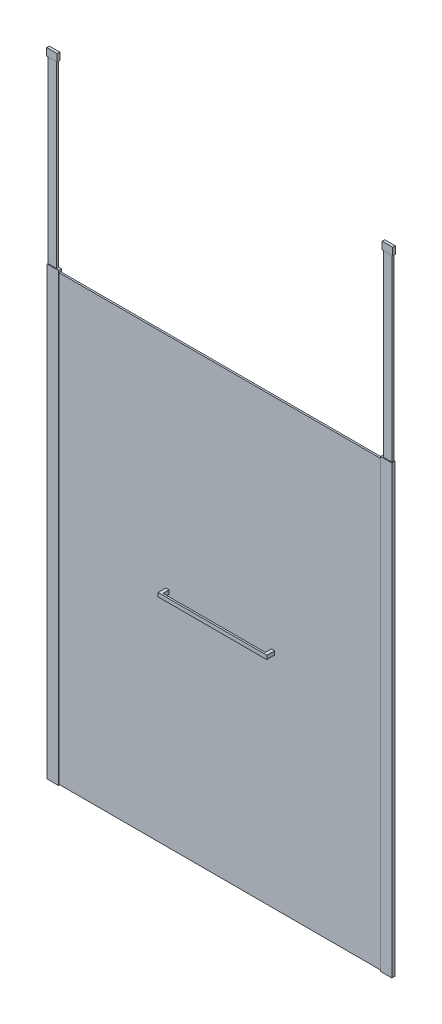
ISO-10303-21;
HEADER;
FILE_DESCRIPTION(('STEP AP214'),'2;1');
FILE_NAME('part.step','',(''),(''),'','','');
FILE_SCHEMA(('AUTOMOTIVE_DESIGN { 1 0 10303 214 1 1 1 1 }'));
ENDSEC;
DATA;
#1=APPLICATION_CONTEXT('core data for automotive mechanical design processes');
#2=APPLICATION_PROTOCOL_DEFINITION('international standard','automotive_design',2000,#1);
#3=PRODUCT_CONTEXT('',#1,'mechanical');
#4=PRODUCT('Part','Part','',(#3));
#5=PRODUCT_RELATED_PRODUCT_CATEGORY('part','',(#4));
#6=PRODUCT_DEFINITION_FORMATION('','',#4);
#7=PRODUCT_DEFINITION_CONTEXT('part definition',#1,'design');
#8=PRODUCT_DEFINITION('design','',#6,#7);
#9=PRODUCT_DEFINITION_SHAPE('','',#8);
#10=(LENGTH_UNIT() NAMED_UNIT(*) SI_UNIT(.MILLI.,.METRE.));
#11=(NAMED_UNIT(*) PLANE_ANGLE_UNIT() SI_UNIT($,.RADIAN.));
#12=(NAMED_UNIT(*) SI_UNIT($,.STERADIAN.) SOLID_ANGLE_UNIT());
#13=UNCERTAINTY_MEASURE_WITH_UNIT(LENGTH_MEASURE(1.E-05),#10,'distance_accuracy_value','');
#14=(GEOMETRIC_REPRESENTATION_CONTEXT(3) GLOBAL_UNCERTAINTY_ASSIGNED_CONTEXT((#13)) GLOBAL_UNIT_ASSIGNED_CONTEXT((#10,
#11,#12)) REPRESENTATION_CONTEXT('',''));
#15=CARTESIAN_POINT('',(0.,0.,0.));
#16=DIRECTION('',(0.,0.,1.));
#17=DIRECTION('',(1.,0.,0.));
#18=AXIS2_PLACEMENT_3D('',#15,#16,#17);
#19=CARTESIAN_POINT('',(573.9,1062.,-21.));
#20=DIRECTION('',(1.,0.,0.));
#21=DIRECTION('',(0.,0.,-1.));
#22=AXIS2_PLACEMENT_3D('',#19,#20,#21);
#23=PLANE('',#22);
#24=DIRECTION('',(0.,1.,0.));
#25=VECTOR('',#24,1.);
#26=CARTESIAN_POINT('',(573.9,1062.,25.5));
#27=LINE('',#26,#25);
#28=CARTESIAN_POINT('',(573.9,1044.,25.5));
#29=VERTEX_POINT('',#28);
#30=CARTESIAN_POINT('',(573.9,1062.,25.5));
#31=VERTEX_POINT('',#30);
#32=EDGE_CURVE('E63',#29,#31,#27,.T.);
#33=ORIENTED_EDGE('',*,*,#32,.F.);
#34=DIRECTION('',(0.,0.,1.));
#35=VECTOR('',#34,1.);
#36=CARTESIAN_POINT('',(573.9,1044.,-21.));
#37=LINE('',#36,#35);
#38=CARTESIAN_POINT('',(573.9,1044.,-21.));
#39=VERTEX_POINT('',#38);
#40=EDGE_CURVE('E12',#39,#29,#37,.T.);
#41=ORIENTED_EDGE('',*,*,#40,.F.);
#42=DIRECTION('',(0.,1.,0.));
#43=VECTOR('',#42,1.);
#44=CARTESIAN_POINT('',(573.9,1062.,-21.));
#45=LINE('',#44,#43);
#46=CARTESIAN_POINT('',(573.9,1062.,-21.));
#47=VERTEX_POINT('',#46);
#48=EDGE_CURVE('E193',#39,#47,#45,.T.);
#49=ORIENTED_EDGE('',*,*,#48,.T.);
#50=DIRECTION('',(0.,0.,1.));
#51=VECTOR('',#50,1.);
#52=CARTESIAN_POINT('',(573.9,1062.,-21.));
#53=LINE('',#52,#51);
#54=EDGE_CURVE('E176',#47,#31,#53,.T.);
#55=ORIENTED_EDGE('',*,*,#54,.T.);
#56=EDGE_LOOP('',(#33,#41,#49,#55));
#57=FACE_BOUND('',#56,.T.);
#58=ADVANCED_FACE('F46',(#57),#23,.T.);
#59=CARTESIAN_POINT('',(558.9,1044.,-21.));
#60=DIRECTION('',(0.,-1.,0.));
#61=DIRECTION('',(0.,0.,-1.));
#62=AXIS2_PLACEMENT_3D('',#59,#60,#61);
#63=PLANE('',#62);
#64=ORIENTED_EDGE('',*,*,#40,.T.);
#65=DIRECTION('',(-1.,0.,0.));
#66=VECTOR('',#65,1.);
#67=CARTESIAN_POINT('',(1078.59771560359,1044.,25.5));
#68=LINE('',#67,#66);
#69=CARTESIAN_POINT('',(1058.9,1044.,25.5));
#70=VERTEX_POINT('',#69);
#71=EDGE_CURVE('E166',#70,#29,#68,.T.);
#72=ORIENTED_EDGE('',*,*,#71,.F.);
#73=DIRECTION('',(0.,0.,1.));
#74=VECTOR('',#73,1.);
#75=CARTESIAN_POINT('',(1058.9,1044.,-21.));
#76=LINE('',#75,#74);
#77=CARTESIAN_POINT('',(1058.9,1044.,-21.));
#78=VERTEX_POINT('',#77);
#79=EDGE_CURVE('E149',#78,#70,#76,.T.);
#80=ORIENTED_EDGE('',*,*,#79,.F.);
#81=DIRECTION('',(1.,0.,0.));
#82=VECTOR('',#81,1.);
#83=CARTESIAN_POINT('',(1058.9,1044.,-21.));
#84=LINE('',#83,#82);
#85=CARTESIAN_POINT('',(1073.9,1044.,-21.));
#86=VERTEX_POINT('',#85);
#87=EDGE_CURVE('E131',#78,#86,#84,.T.);
#88=ORIENTED_EDGE('',*,*,#87,.T.);
#89=DIRECTION('',(0.,0.,1.));
#90=VECTOR('',#89,1.);
#91=CARTESIAN_POINT('',(1073.9,1044.,-21.));
#92=LINE('',#91,#90);
#93=CARTESIAN_POINT('',(1073.9,1044.,33.5));
#94=VERTEX_POINT('',#93);
#95=EDGE_CURVE('E147',#86,#94,#92,.T.);
#96=ORIENTED_EDGE('',*,*,#95,.T.);
#97=DIRECTION('',(1.,0.,0.));
#98=VECTOR('',#97,1.);
#99=CARTESIAN_POINT('',(558.9,1044.,33.5));
#100=LINE('',#99,#98);
#101=CARTESIAN_POINT('',(558.9,1044.,33.5));
#102=VERTEX_POINT('',#101);
#103=EDGE_CURVE('E135',#102,#94,#100,.T.);
#104=ORIENTED_EDGE('',*,*,#103,.F.);
#105=DIRECTION('',(0.,0.,1.));
#106=VECTOR('',#105,1.);
#107=CARTESIAN_POINT('',(558.9,1044.,-21.));
#108=LINE('',#107,#106);
#109=CARTESIAN_POINT('',(558.9,1044.,-21.));
#110=VERTEX_POINT('',#109);
#111=EDGE_CURVE('E55',#110,#102,#108,.T.);
#112=ORIENTED_EDGE('',*,*,#111,.F.);
#113=DIRECTION('',(1.,0.,0.));
#114=VECTOR('',#113,1.);
#115=CARTESIAN_POINT('',(558.9,1044.,-21.));
#116=LINE('',#115,#114);
#117=EDGE_CURVE('E181',#110,#39,#116,.T.);
#118=ORIENTED_EDGE('',*,*,#117,.T.);
#119=EDGE_LOOP('',(#64,#72,#80,#88,#96,#104,#112,#118));
#120=FACE_BOUND('',#119,.T.);
#121=ADVANCED_FACE('F197',(#120),#63,.T.);
#122=CARTESIAN_POINT('',(558.9,1062.,-21.));
#123=DIRECTION('',(-1.,0.,0.));
#124=DIRECTION('',(0.,0.,1.));
#125=AXIS2_PLACEMENT_3D('',#122,#123,#124);
#126=PLANE('',#125);
#127=ORIENTED_EDGE('',*,*,#111,.T.);
#128=DIRECTION('',(0.,-1.,0.));
#129=VECTOR('',#128,1.);
#130=CARTESIAN_POINT('',(558.9,1062.,33.5));
#131=LINE('',#130,#129);
#132=CARTESIAN_POINT('',(558.9,1062.,33.5));
#133=VERTEX_POINT('',#132);
#134=EDGE_CURVE('E121',#133,#102,#131,.T.);
#135=ORIENTED_EDGE('',*,*,#134,.F.);
#136=DIRECTION('',(0.,0.,1.));
#137=VECTOR('',#136,1.);
#138=CARTESIAN_POINT('',(558.9,1062.,-21.));
#139=LINE('',#138,#137);
#140=CARTESIAN_POINT('',(558.9,1062.,-21.));
#141=VERTEX_POINT('',#140);
#142=EDGE_CURVE('E116',#141,#133,#139,.T.);
#143=ORIENTED_EDGE('',*,*,#142,.F.);
#144=DIRECTION('',(0.,-1.,0.));
#145=VECTOR('',#144,1.);
#146=CARTESIAN_POINT('',(558.9,1062.,-21.));
#147=LINE('',#146,#145);
#148=EDGE_CURVE('E186',#141,#110,#147,.T.);
#149=ORIENTED_EDGE('',*,*,#148,.T.);
#150=EDGE_LOOP('',(#127,#135,#143,#149));
#151=FACE_BOUND('',#150,.T.);
#152=ADVANCED_FACE('F218',(#151),#126,.T.);
#153=CARTESIAN_POINT('',(558.9,1062.,-21.));
#154=DIRECTION('',(0.,1.,0.));
#155=DIRECTION('',(0.,0.,1.));
#156=AXIS2_PLACEMENT_3D('',#153,#154,#155);
#157=PLANE('',#156);
#158=ORIENTED_EDGE('',*,*,#142,.T.);
#159=DIRECTION('',(-1.,0.,0.));
#160=VECTOR('',#159,1.);
#161=CARTESIAN_POINT('',(558.9,1062.,33.5));
#162=LINE('',#161,#160);
#163=CARTESIAN_POINT('',(1073.9,1062.,33.5));
#164=VERTEX_POINT('',#163);
#165=EDGE_CURVE('E109',#164,#133,#162,.T.);
#166=ORIENTED_EDGE('',*,*,#165,.F.);
#167=DIRECTION('',(0.,0.,1.));
#168=VECTOR('',#167,1.);
#169=CARTESIAN_POINT('',(1073.9,1062.,-21.));
#170=LINE('',#169,#168);
#171=CARTESIAN_POINT('',(1073.9,1062.,-21.));
#172=VERTEX_POINT('',#171);
#173=EDGE_CURVE('E113',#172,#164,#170,.T.);
#174=ORIENTED_EDGE('',*,*,#173,.F.);
#175=DIRECTION('',(-1.,0.,0.));
#176=VECTOR('',#175,1.);
#177=CARTESIAN_POINT('',(1058.9,1062.,-21.));
#178=LINE('',#177,#176);
#179=CARTESIAN_POINT('',(1058.9,1062.,-21.));
#180=VERTEX_POINT('',#179);
#181=EDGE_CURVE('E138',#172,#180,#178,.T.);
#182=ORIENTED_EDGE('',*,*,#181,.T.);
#183=DIRECTION('',(0.,0.,1.));
#184=VECTOR('',#183,1.);
#185=CARTESIAN_POINT('',(1058.9,1062.,-21.));
#186=LINE('',#185,#184);
#187=CARTESIAN_POINT('',(1058.9,1062.,25.5));
#188=VERTEX_POINT('',#187);
#189=EDGE_CURVE('E130',#180,#188,#186,.T.);
#190=ORIENTED_EDGE('',*,*,#189,.T.);
#191=DIRECTION('',(-1.,0.,0.));
#192=VECTOR('',#191,1.);
#193=CARTESIAN_POINT('',(1078.59771560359,1062.,25.5));
#194=LINE('',#193,#192);
#195=EDGE_CURVE('E163',#188,#31,#194,.T.);
#196=ORIENTED_EDGE('',*,*,#195,.T.);
#197=ORIENTED_EDGE('',*,*,#54,.F.);
#198=DIRECTION('',(-1.,0.,0.));
#199=VECTOR('',#198,1.);
#200=CARTESIAN_POINT('',(558.9,1062.,-21.));
#201=LINE('',#200,#199);
#202=EDGE_CURVE('E190',#47,#141,#201,.T.);
#203=ORIENTED_EDGE('',*,*,#202,.T.);
#204=EDGE_LOOP('',(#158,#166,#174,#182,#190,#196,#197,#203));
#205=FACE_BOUND('',#204,.T.);
#206=ADVANCED_FACE('F111',(#205),#157,.T.);
#207=CARTESIAN_POINT('',(573.9,1044.,-21.));
#208=DIRECTION('',(0.,0.,1.));
#209=DIRECTION('',(1.,0.,0.));
#210=AXIS2_PLACEMENT_3D('',#207,#208,#209);
#211=PLANE('',#210);
#212=ORIENTED_EDGE('',*,*,#48,.F.);
#213=ORIENTED_EDGE('',*,*,#117,.F.);
#214=ORIENTED_EDGE('',*,*,#148,.F.);
#215=ORIENTED_EDGE('',*,*,#202,.F.);
#216=EDGE_LOOP('',(#212,#213,#214,#215));
#217=FACE_BOUND('',#216,.T.);
#218=ADVANCED_FACE('F225',(#217),#211,.F.);
#219=CARTESIAN_POINT('',(573.9,1044.,33.5));
#220=DIRECTION('',(0.,0.,1.));
#221=DIRECTION('',(1.,0.,0.));
#222=AXIS2_PLACEMENT_3D('',#219,#220,#221);
#223=PLANE('',#222);
#224=ORIENTED_EDGE('',*,*,#103,.T.);
#225=DIRECTION('',(0.,1.,0.));
#226=VECTOR('',#225,1.);
#227=CARTESIAN_POINT('',(1073.9,1062.,33.5));
#228=LINE('',#227,#226);
#229=EDGE_CURVE('E127',#94,#164,#228,.T.);
#230=ORIENTED_EDGE('',*,*,#229,.T.);
#231=ORIENTED_EDGE('',*,*,#165,.T.);
#232=ORIENTED_EDGE('',*,*,#134,.T.);
#233=EDGE_LOOP('',(#224,#230,#231,#232));
#234=FACE_BOUND('',#233,.T.);
#235=ADVANCED_FACE('F133',(#234),#223,.T.);
#236=CARTESIAN_POINT('',(1078.59771560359,1062.,25.5));
#237=DIRECTION('',(0.,0.,1.));
#238=DIRECTION('',(0.,-1.,0.));
#239=AXIS2_PLACEMENT_3D('',#236,#237,#238);
#240=PLANE('',#239);
#241=ORIENTED_EDGE('',*,*,#195,.F.);
#242=DIRECTION('',(0.,-1.,0.));
#243=VECTOR('',#242,1.);
#244=CARTESIAN_POINT('',(1058.9,1062.,25.5));
#245=LINE('',#244,#243);
#246=EDGE_CURVE('E49',#188,#70,#245,.T.);
#247=ORIENTED_EDGE('',*,*,#246,.T.);
#248=ORIENTED_EDGE('',*,*,#71,.T.);
#249=ORIENTED_EDGE('',*,*,#32,.T.);
#250=EDGE_LOOP('',(#241,#247,#248,#249));
#251=FACE_BOUND('',#250,.T.);
#252=ADVANCED_FACE('F203',(#251),#240,.F.);
#253=CARTESIAN_POINT('',(1058.9,1062.,-21.));
#254=DIRECTION('',(-1.,0.,0.));
#255=DIRECTION('',(0.,0.,1.));
#256=AXIS2_PLACEMENT_3D('',#253,#254,#255);
#257=PLANE('',#256);
#258=ORIENTED_EDGE('',*,*,#246,.F.);
#259=ORIENTED_EDGE('',*,*,#189,.F.);
#260=DIRECTION('',(0.,-1.,0.));
#261=VECTOR('',#260,1.);
#262=CARTESIAN_POINT('',(1058.9,1062.,-21.));
#263=LINE('',#262,#261);
#264=EDGE_CURVE('E142',#180,#78,#263,.T.);
#265=ORIENTED_EDGE('',*,*,#264,.T.);
#266=ORIENTED_EDGE('',*,*,#79,.T.);
#267=EDGE_LOOP('',(#258,#259,#265,#266));
#268=FACE_BOUND('',#267,.T.);
#269=ADVANCED_FACE('F204',(#268),#257,.T.);
#270=CARTESIAN_POINT('',(1073.9,1062.,-21.));
#271=DIRECTION('',(1.,0.,0.));
#272=DIRECTION('',(0.,0.,-1.));
#273=AXIS2_PLACEMENT_3D('',#270,#271,#272);
#274=PLANE('',#273);
#275=ORIENTED_EDGE('',*,*,#173,.T.);
#276=ORIENTED_EDGE('',*,*,#229,.F.);
#277=ORIENTED_EDGE('',*,*,#95,.F.);
#278=DIRECTION('',(0.,1.,0.));
#279=VECTOR('',#278,1.);
#280=CARTESIAN_POINT('',(1073.9,1062.,-21.));
#281=LINE('',#280,#279);
#282=EDGE_CURVE('E129',#86,#172,#281,.T.);
#283=ORIENTED_EDGE('',*,*,#282,.T.);
#284=EDGE_LOOP('',(#275,#276,#277,#283));
#285=FACE_BOUND('',#284,.T.);
#286=ADVANCED_FACE('F126',(#285),#274,.T.);
#287=CARTESIAN_POINT('',(1073.9,1044.,-21.));
#288=DIRECTION('',(0.,0.,1.));
#289=DIRECTION('',(1.,0.,0.));
#290=AXIS2_PLACEMENT_3D('',#287,#288,#289);
#291=PLANE('',#290);
#292=ORIENTED_EDGE('',*,*,#282,.F.);
#293=ORIENTED_EDGE('',*,*,#87,.F.);
#294=ORIENTED_EDGE('',*,*,#264,.F.);
#295=ORIENTED_EDGE('',*,*,#181,.F.);
#296=EDGE_LOOP('',(#292,#293,#294,#295));
#297=FACE_BOUND('',#296,.T.);
#298=ADVANCED_FACE('F200',(#297),#291,.F.);
#299=CLOSED_SHELL('',(#58,#121,#152,#206,#218,#235,#252,#269,#286,#298));
#300=MANIFOLD_SOLID_BREP('B2',#299);
#301=CARTESIAN_POINT('',(46.5,3000.,-13.2499999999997));
#302=DIRECTION('',(-1.,0.,0.));
#303=DIRECTION('',(0.,-1.,0.));
#304=AXIS2_PLACEMENT_3D('',#301,#302,#303);
#305=PLANE('',#304);
#306=DIRECTION('',(0.,0.,-1.));
#307=VECTOR('',#306,1.);
#308=CARTESIAN_POINT('',(46.5,2965.,-13.2499999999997));
#309=LINE('',#308,#307);
#310=CARTESIAN_POINT('',(46.5,2965.,-0.749999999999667));
#311=VERTEX_POINT('',#310);
#312=CARTESIAN_POINT('',(46.5,2965.,-13.2499999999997));
#313=VERTEX_POINT('',#312);
#314=EDGE_CURVE('E381',#311,#313,#309,.T.);
#315=ORIENTED_EDGE('',*,*,#314,.T.);
#316=DIRECTION('',(0.,-1.,0.));
#317=VECTOR('',#316,1.);
#318=CARTESIAN_POINT('',(46.5,3000.,-13.2499999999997));
#319=LINE('',#318,#317);
#320=CARTESIAN_POINT('',(46.5,3000.,-13.2499999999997));
#321=VERTEX_POINT('',#320);
#322=EDGE_CURVE('E44',#321,#313,#319,.T.);
#323=ORIENTED_EDGE('',*,*,#322,.F.);
#324=DIRECTION('',(0.,0.,-1.));
#325=VECTOR('',#324,1.);
#326=CARTESIAN_POINT('',(46.5,3000.,-13.2499999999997));
#327=LINE('',#326,#325);
#328=CARTESIAN_POINT('',(46.5,3000.,-0.74999999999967));
#329=VERTEX_POINT('',#328);
#330=EDGE_CURVE('E369',#329,#321,#327,.T.);
#331=ORIENTED_EDGE('',*,*,#330,.F.);
#332=DIRECTION('',(0.,-1.,0.));
#333=VECTOR('',#332,1.);
#334=CARTESIAN_POINT('',(46.5,3000.,-0.74999999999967));
#335=LINE('',#334,#333);
#336=EDGE_CURVE('E377',#329,#311,#335,.T.);
#337=ORIENTED_EDGE('',*,*,#336,.T.);
#338=EDGE_LOOP('',(#315,#323,#331,#337));
#339=FACE_BOUND('',#338,.T.);
#340=ADVANCED_FACE('F318',(#339),#305,.F.);
#341=CARTESIAN_POINT('',(-3.5,3000.,-13.2499999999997));
#342=DIRECTION('',(0.,0.,1.));
#343=DIRECTION('',(0.,-1.,0.));
#344=AXIS2_PLACEMENT_3D('',#341,#342,#343);
#345=PLANE('',#344);
#346=DIRECTION('',(-1.,0.,0.));
#347=VECTOR('',#346,1.);
#348=CARTESIAN_POINT('',(-3.5,2965.,-13.2499999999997));
#349=LINE('',#348,#347);
#350=CARTESIAN_POINT('',(-3.5,2965.,-13.2499999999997));
#351=VERTEX_POINT('',#350);
#352=EDGE_CURVE('E373',#313,#351,#349,.T.);
#353=ORIENTED_EDGE('',*,*,#352,.T.);
#354=DIRECTION('',(0.,-1.,0.));
#355=VECTOR('',#354,1.);
#356=CARTESIAN_POINT('',(-3.5,3000.,-13.2499999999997));
#357=LINE('',#356,#355);
#358=CARTESIAN_POINT('',(-3.5,3000.,-13.2499999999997));
#359=VERTEX_POINT('',#358);
#360=EDGE_CURVE('E326',#359,#351,#357,.T.);
#361=ORIENTED_EDGE('',*,*,#360,.F.);
#362=DIRECTION('',(-1.,0.,0.));
#363=VECTOR('',#362,1.);
#364=CARTESIAN_POINT('',(-3.5,3000.,-13.2499999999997));
#365=LINE('',#364,#363);
#366=EDGE_CURVE('E364',#321,#359,#365,.T.);
#367=ORIENTED_EDGE('',*,*,#366,.F.);
#368=ORIENTED_EDGE('',*,*,#322,.T.);
#369=EDGE_LOOP('',(#353,#361,#367,#368));
#370=FACE_BOUND('',#369,.T.);
#371=ADVANCED_FACE('F372',(#370),#345,.F.);
#372=CARTESIAN_POINT('',(-3.5,3000.,-13.2499999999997));
#373=DIRECTION('',(1.,0.,0.));
#374=DIRECTION('',(0.,0.,-1.));
#375=AXIS2_PLACEMENT_3D('',#372,#373,#374);
#376=PLANE('',#375);
#377=DIRECTION('',(0.,0.,1.));
#378=VECTOR('',#377,1.);
#379=CARTESIAN_POINT('',(-3.5,2965.,-13.2499999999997));
#380=LINE('',#379,#378);
#381=CARTESIAN_POINT('',(-3.5,2965.,-0.749999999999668));
#382=VERTEX_POINT('',#381);
#383=EDGE_CURVE('E351',#351,#382,#380,.T.);
#384=ORIENTED_EDGE('',*,*,#383,.T.);
#385=DIRECTION('',(0.,-1.,0.));
#386=VECTOR('',#385,1.);
#387=CARTESIAN_POINT('',(-3.5,3000.,-0.74999999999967));
#388=LINE('',#387,#386);
#389=CARTESIAN_POINT('',(-3.5,3000.,-0.74999999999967));
#390=VERTEX_POINT('',#389);
#391=EDGE_CURVE('E374',#390,#382,#388,.T.);
#392=ORIENTED_EDGE('',*,*,#391,.F.);
#393=DIRECTION('',(0.,0.,1.));
#394=VECTOR('',#393,1.);
#395=CARTESIAN_POINT('',(-3.5,3000.,-13.2499999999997));
#396=LINE('',#395,#394);
#397=EDGE_CURVE('E367',#359,#390,#396,.T.);
#398=ORIENTED_EDGE('',*,*,#397,.F.);
#399=ORIENTED_EDGE('',*,*,#360,.T.);
#400=EDGE_LOOP('',(#384,#392,#398,#399));
#401=FACE_BOUND('',#400,.T.);
#402=ADVANCED_FACE('F375',(#401),#376,.F.);
#403=CARTESIAN_POINT('',(-3.5,3000.,-0.74999999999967));
#404=DIRECTION('',(0.,0.,-1.));
#405=DIRECTION('',(0.,1.,0.));
#406=AXIS2_PLACEMENT_3D('',#403,#404,#405);
#407=PLANE('',#406);
#408=DIRECTION('',(1.,0.,0.));
#409=VECTOR('',#408,1.);
#410=CARTESIAN_POINT('',(-3.5,2965.,-0.749999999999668));
#411=LINE('',#410,#409);
#412=EDGE_CURVE('E357',#382,#311,#411,.T.);
#413=ORIENTED_EDGE('',*,*,#412,.T.);
#414=ORIENTED_EDGE('',*,*,#336,.F.);
#415=DIRECTION('',(1.,0.,0.));
#416=VECTOR('',#415,1.);
#417=CARTESIAN_POINT('',(-3.5,3000.,-0.74999999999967));
#418=LINE('',#417,#416);
#419=EDGE_CURVE('E334',#390,#329,#418,.T.);
#420=ORIENTED_EDGE('',*,*,#419,.F.);
#421=ORIENTED_EDGE('',*,*,#391,.T.);
#422=EDGE_LOOP('',(#413,#414,#420,#421));
#423=FACE_BOUND('',#422,.T.);
#424=ADVANCED_FACE('F388',(#423),#407,.F.);
#425=CARTESIAN_POINT('',(46.5,3000.,-0.74999999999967));
#426=DIRECTION('',(0.,1.,0.));
#427=DIRECTION('',(0.,0.,1.));
#428=AXIS2_PLACEMENT_3D('',#425,#426,#427);
#429=PLANE('',#428);
#430=ORIENTED_EDGE('',*,*,#330,.T.);
#431=ORIENTED_EDGE('',*,*,#366,.T.);
#432=ORIENTED_EDGE('',*,*,#397,.T.);
#433=ORIENTED_EDGE('',*,*,#419,.T.);
#434=EDGE_LOOP('',(#430,#431,#432,#433));
#435=FACE_BOUND('',#434,.T.);
#436=ADVANCED_FACE('F365',(#435),#429,.T.);
#437=CARTESIAN_POINT('',(46.5,2965.,-0.749999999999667));
#438=DIRECTION('',(0.,1.,0.));
#439=DIRECTION('',(0.,0.,1.));
#440=AXIS2_PLACEMENT_3D('',#437,#438,#439);
#441=PLANE('',#440);
#442=ORIENTED_EDGE('',*,*,#314,.F.);
#443=ORIENTED_EDGE('',*,*,#412,.F.);
#444=ORIENTED_EDGE('',*,*,#383,.F.);
#445=ORIENTED_EDGE('',*,*,#352,.F.);
#446=EDGE_LOOP('',(#442,#443,#444,#445));
#447=FACE_BOUND('',#446,.T.);
#448=ADVANCED_FACE('F391',(#447),#441,.F.);
#449=CLOSED_SHELL('',(#340,#371,#402,#424,#436,#448));
#450=MANIFOLD_SOLID_BREP('B6',#449);
#451=CARTESIAN_POINT('',(1.5,2997.,-2.99999999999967));
#452=DIRECTION('',(-1.,0.,0.));
#453=DIRECTION('',(0.,0.,1.));
#454=AXIS2_PLACEMENT_3D('',#451,#452,#453);
#455=PLANE('',#454);
#456=DIRECTION('',(0.,0.,-1.));
#457=VECTOR('',#456,1.);
#458=CARTESIAN_POINT('',(1.5,2114.,-2.99999999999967));
#459=LINE('',#458,#457);
#460=CARTESIAN_POINT('',(1.5,2114.,-2.99999999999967));
#461=VERTEX_POINT('',#460);
#462=CARTESIAN_POINT('',(1.5,2114.,-10.9999999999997));
#463=VERTEX_POINT('',#462);
#464=EDGE_CURVE('E516',#461,#463,#459,.T.);
#465=ORIENTED_EDGE('',*,*,#464,.F.);
#466=DIRECTION('',(0.,-1.,0.));
#467=VECTOR('',#466,1.);
#468=CARTESIAN_POINT('',(1.5,2997.,-2.99999999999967));
#469=LINE('',#468,#467);
#470=CARTESIAN_POINT('',(1.5,2997.,-2.99999999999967));
#471=VERTEX_POINT('',#470);
#472=EDGE_CURVE('E316',#471,#461,#469,.T.);
#473=ORIENTED_EDGE('',*,*,#472,.F.);
#474=DIRECTION('',(0.,0.,-1.));
#475=VECTOR('',#474,1.);
#476=CARTESIAN_POINT('',(1.5,2997.,-2.99999999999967));
#477=LINE('',#476,#475);
#478=CARTESIAN_POINT('',(1.5,2997.,-10.9999999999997));
#479=VERTEX_POINT('',#478);
#480=EDGE_CURVE('E510',#471,#479,#477,.T.);
#481=ORIENTED_EDGE('',*,*,#480,.T.);
#482=DIRECTION('',(0.,-1.,0.));
#483=VECTOR('',#482,1.);
#484=CARTESIAN_POINT('',(1.5,2997.,-10.9999999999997));
#485=LINE('',#484,#483);
#486=EDGE_CURVE('E455',#479,#463,#485,.T.);
#487=ORIENTED_EDGE('',*,*,#486,.T.);
#488=EDGE_LOOP('',(#465,#473,#481,#487));
#489=FACE_BOUND('',#488,.T.);
#490=ADVANCED_FACE('F452',(#489),#455,.T.);
#491=CARTESIAN_POINT('',(1.5,2997.,-2.99999999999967));
#492=DIRECTION('',(0.,0.,1.));
#493=DIRECTION('',(1.,0.,0.));
#494=AXIS2_PLACEMENT_3D('',#491,#492,#493);
#495=PLANE('',#494);
#496=DIRECTION('',(-1.,0.,0.));
#497=VECTOR('',#496,1.);
#498=CARTESIAN_POINT('',(1.5,2114.,-2.99999999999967));
#499=LINE('',#498,#497);
#500=CARTESIAN_POINT('',(41.5,2114.,-2.99999999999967));
#501=VERTEX_POINT('',#500);
#502=EDGE_CURVE('E512',#501,#461,#499,.T.);
#503=ORIENTED_EDGE('',*,*,#502,.F.);
#504=DIRECTION('',(0.,-1.,0.));
#505=VECTOR('',#504,1.);
#506=CARTESIAN_POINT('',(41.5,2997.,-2.99999999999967));
#507=LINE('',#506,#505);
#508=CARTESIAN_POINT('',(41.5,2997.,-2.99999999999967));
#509=VERTEX_POINT('',#508);
#510=EDGE_CURVE('E461',#509,#501,#507,.T.);
#511=ORIENTED_EDGE('',*,*,#510,.F.);
#512=DIRECTION('',(-1.,0.,0.));
#513=VECTOR('',#512,1.);
#514=CARTESIAN_POINT('',(1.5,2997.,-2.99999999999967));
#515=LINE('',#514,#513);
#516=EDGE_CURVE('E507',#509,#471,#515,.T.);
#517=ORIENTED_EDGE('',*,*,#516,.T.);
#518=ORIENTED_EDGE('',*,*,#472,.T.);
#519=EDGE_LOOP('',(#503,#511,#517,#518));
#520=FACE_BOUND('',#519,.T.);
#521=ADVANCED_FACE('F526',(#520),#495,.T.);
#522=CARTESIAN_POINT('',(41.5,2997.,-2.99999999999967));
#523=DIRECTION('',(1.,0.,0.));
#524=DIRECTION('',(0.,0.,-1.));
#525=AXIS2_PLACEMENT_3D('',#522,#523,#524);
#526=PLANE('',#525);
#527=DIRECTION('',(0.,0.,1.));
#528=VECTOR('',#527,1.);
#529=CARTESIAN_POINT('',(41.5,2114.,-2.99999999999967));
#530=LINE('',#529,#528);
#531=CARTESIAN_POINT('',(41.5,2114.,-10.9999999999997));
#532=VERTEX_POINT('',#531);
#533=EDGE_CURVE('E502',#532,#501,#530,.T.);
#534=ORIENTED_EDGE('',*,*,#533,.F.);
#535=DIRECTION('',(0.,-1.,0.));
#536=VECTOR('',#535,1.);
#537=CARTESIAN_POINT('',(41.5,2997.,-10.9999999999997));
#538=LINE('',#537,#536);
#539=CARTESIAN_POINT('',(41.5,2997.,-10.9999999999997));
#540=VERTEX_POINT('',#539);
#541=EDGE_CURVE('E497',#540,#532,#538,.T.);
#542=ORIENTED_EDGE('',*,*,#541,.F.);
#543=DIRECTION('',(0.,0.,1.));
#544=VECTOR('',#543,1.);
#545=CARTESIAN_POINT('',(41.5,2997.,-2.99999999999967));
#546=LINE('',#545,#544);
#547=EDGE_CURVE('E500',#540,#509,#546,.T.);
#548=ORIENTED_EDGE('',*,*,#547,.T.);
#549=ORIENTED_EDGE('',*,*,#510,.T.);
#550=EDGE_LOOP('',(#534,#542,#548,#549));
#551=FACE_BOUND('',#550,.T.);
#552=ADVANCED_FACE('F499',(#551),#526,.T.);
#553=CARTESIAN_POINT('',(1.5,2997.,-10.9999999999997));
#554=DIRECTION('',(0.,0.,-1.));
#555=DIRECTION('',(-1.,0.,0.));
#556=AXIS2_PLACEMENT_3D('',#553,#554,#555);
#557=PLANE('',#556);
#558=DIRECTION('',(1.,0.,0.));
#559=VECTOR('',#558,1.);
#560=CARTESIAN_POINT('',(1.5,2114.,-10.9999999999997));
#561=LINE('',#560,#559);
#562=EDGE_CURVE('E519',#463,#532,#561,.T.);
#563=ORIENTED_EDGE('',*,*,#562,.F.);
#564=ORIENTED_EDGE('',*,*,#486,.F.);
#565=DIRECTION('',(1.,0.,0.));
#566=VECTOR('',#565,1.);
#567=CARTESIAN_POINT('',(1.5,2997.,-10.9999999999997));
#568=LINE('',#567,#566);
#569=EDGE_CURVE('E506',#479,#540,#568,.T.);
#570=ORIENTED_EDGE('',*,*,#569,.T.);
#571=ORIENTED_EDGE('',*,*,#541,.T.);
#572=EDGE_LOOP('',(#563,#564,#570,#571));
#573=FACE_BOUND('',#572,.T.);
#574=ADVANCED_FACE('F509',(#573),#557,.T.);
#575=CARTESIAN_POINT('',(1.5,2997.,-10.9999999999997));
#576=DIRECTION('',(0.,-1.,0.));
#577=DIRECTION('',(0.,0.,-1.));
#578=AXIS2_PLACEMENT_3D('',#575,#576,#577);
#579=PLANE('',#578);
#580=ORIENTED_EDGE('',*,*,#480,.F.);
#581=ORIENTED_EDGE('',*,*,#516,.F.);
#582=ORIENTED_EDGE('',*,*,#547,.F.);
#583=ORIENTED_EDGE('',*,*,#569,.F.);
#584=EDGE_LOOP('',(#580,#581,#582,#583));
#585=FACE_BOUND('',#584,.T.);
#586=ADVANCED_FACE('F505',(#585),#579,.F.);
#587=CARTESIAN_POINT('',(1.5,2114.,-10.9999999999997));
#588=DIRECTION('',(0.,-1.,0.));
#589=DIRECTION('',(0.,0.,-1.));
#590=AXIS2_PLACEMENT_3D('',#587,#588,#589);
#591=PLANE('',#590);
#592=ORIENTED_EDGE('',*,*,#464,.T.);
#593=ORIENTED_EDGE('',*,*,#562,.T.);
#594=ORIENTED_EDGE('',*,*,#533,.T.);
#595=ORIENTED_EDGE('',*,*,#502,.T.);
#596=EDGE_LOOP('',(#592,#593,#594,#595));
#597=FACE_BOUND('',#596,.T.);
#598=ADVANCED_FACE('F525',(#597),#591,.T.);
#599=CLOSED_SHELL('',(#490,#521,#552,#574,#586,#598));
#600=MANIFOLD_SOLID_BREP('B38',#599);
#601=CARTESIAN_POINT('',(1586.3,3000.,-0.749999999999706));
#602=DIRECTION('',(1.,0.,0.));
#603=DIRECTION('',(0.,1.,0.));
#604=AXIS2_PLACEMENT_3D('',#601,#602,#603);
#605=PLANE('',#604);
#606=DIRECTION('',(0.,0.,1.));
#607=VECTOR('',#606,1.);
#608=CARTESIAN_POINT('',(1586.3,2965.,-0.749999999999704));
#609=LINE('',#608,#607);
#610=CARTESIAN_POINT('',(1586.3,2965.,-13.2499999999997));
#611=VERTEX_POINT('',#610);
#612=CARTESIAN_POINT('',(1586.3,2965.,-0.749999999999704));
#613=VERTEX_POINT('',#612);
#614=EDGE_CURVE('E674',#611,#613,#609,.T.);
#615=ORIENTED_EDGE('',*,*,#614,.T.);
#616=DIRECTION('',(0.,-1.,0.));
#617=VECTOR('',#616,1.);
#618=CARTESIAN_POINT('',(1586.3,3000.,-0.749999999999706));
#619=LINE('',#618,#617);
#620=CARTESIAN_POINT('',(1586.3,3000.,-0.749999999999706));
#621=VERTEX_POINT('',#620);
#622=EDGE_CURVE('E655',#621,#613,#619,.T.);
#623=ORIENTED_EDGE('',*,*,#622,.F.);
#624=DIRECTION('',(0.,0.,1.));
#625=VECTOR('',#624,1.);
#626=CARTESIAN_POINT('',(1586.3,3000.,-0.749999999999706));
#627=LINE('',#626,#625);
#628=CARTESIAN_POINT('',(1586.3,3000.,-13.2499999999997));
#629=VERTEX_POINT('',#628);
#630=EDGE_CURVE('E662',#629,#621,#627,.T.);
#631=ORIENTED_EDGE('',*,*,#630,.F.);
#632=DIRECTION('',(0.,-1.,0.));
#633=VECTOR('',#632,1.);
#634=CARTESIAN_POINT('',(1586.3,3000.,-13.2499999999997));
#635=LINE('',#634,#633);
#636=EDGE_CURVE('E813',#629,#611,#635,.T.);
#637=ORIENTED_EDGE('',*,*,#636,.T.);
#638=EDGE_LOOP('',(#615,#623,#631,#637));
#639=FACE_BOUND('',#638,.T.);
#640=ADVANCED_FACE('F586',(#639),#605,.F.);
#641=CARTESIAN_POINT('',(1636.3,3000.,-0.749999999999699));
#642=DIRECTION('',(0.,0.,-1.));
#643=DIRECTION('',(-1.,0.,0.));
#644=AXIS2_PLACEMENT_3D('',#641,#642,#643);
#645=PLANE('',#644);
#646=DIRECTION('',(1.,0.,0.));
#647=VECTOR('',#646,1.);
#648=CARTESIAN_POINT('',(1636.3,2965.,-0.749999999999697));
#649=LINE('',#648,#647);
#650=CARTESIAN_POINT('',(1636.3,2965.,-0.749999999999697));
#651=VERTEX_POINT('',#650);
#652=EDGE_CURVE('E811',#613,#651,#649,.T.);
#653=ORIENTED_EDGE('',*,*,#652,.T.);
#654=DIRECTION('',(0.,-1.,0.));
#655=VECTOR('',#654,1.);
#656=CARTESIAN_POINT('',(1636.3,3000.,-0.749999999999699));
#657=LINE('',#656,#655);
#658=CARTESIAN_POINT('',(1636.3,3000.,-0.749999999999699));
#659=VERTEX_POINT('',#658);
#660=EDGE_CURVE('E658',#659,#651,#657,.T.);
#661=ORIENTED_EDGE('',*,*,#660,.F.);
#662=DIRECTION('',(1.,0.,0.));
#663=VECTOR('',#662,1.);
#664=CARTESIAN_POINT('',(1636.3,3000.,-0.749999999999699));
#665=LINE('',#664,#663);
#666=EDGE_CURVE('E651',#621,#659,#665,.T.);
#667=ORIENTED_EDGE('',*,*,#666,.F.);
#668=ORIENTED_EDGE('',*,*,#622,.T.);
#669=EDGE_LOOP('',(#653,#661,#667,#668));
#670=FACE_BOUND('',#669,.T.);
#671=ADVANCED_FACE('F653',(#670),#645,.F.);
#672=CARTESIAN_POINT('',(1636.3,3000.,-0.749999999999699));
#673=DIRECTION('',(-1.,0.,0.));
#674=DIRECTION('',(0.,-1.,0.));
#675=AXIS2_PLACEMENT_3D('',#672,#673,#674);
#676=PLANE('',#675);
#677=DIRECTION('',(0.,0.,-1.));
#678=VECTOR('',#677,1.);
#679=CARTESIAN_POINT('',(1636.3,2965.,-0.749999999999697));
#680=LINE('',#679,#678);
#681=CARTESIAN_POINT('',(1636.3,2965.,-13.2499999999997));
#682=VERTEX_POINT('',#681);
#683=EDGE_CURVE('E807',#651,#682,#680,.T.);
#684=ORIENTED_EDGE('',*,*,#683,.T.);
#685=DIRECTION('',(0.,-1.,0.));
#686=VECTOR('',#685,1.);
#687=CARTESIAN_POINT('',(1636.3,3000.,-13.2499999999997));
#688=LINE('',#687,#686);
#689=CARTESIAN_POINT('',(1636.3,3000.,-13.2499999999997));
#690=VERTEX_POINT('',#689);
#691=EDGE_CURVE('E678',#690,#682,#688,.T.);
#692=ORIENTED_EDGE('',*,*,#691,.F.);
#693=DIRECTION('',(0.,0.,-1.));
#694=VECTOR('',#693,1.);
#695=CARTESIAN_POINT('',(1636.3,3000.,-0.749999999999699));
#696=LINE('',#695,#694);
#697=EDGE_CURVE('E661',#659,#690,#696,.T.);
#698=ORIENTED_EDGE('',*,*,#697,.F.);
#699=ORIENTED_EDGE('',*,*,#660,.T.);
#700=EDGE_LOOP('',(#684,#692,#698,#699));
#701=FACE_BOUND('',#700,.T.);
#702=ADVANCED_FACE('F728',(#701),#676,.F.);
#703=CARTESIAN_POINT('',(1636.3,3000.,-13.2499999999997));
#704=DIRECTION('',(0.,0.,1.));
#705=DIRECTION('',(1.,0.,0.));
#706=AXIS2_PLACEMENT_3D('',#703,#704,#705);
#707=PLANE('',#706);
#708=DIRECTION('',(-1.,0.,0.));
#709=VECTOR('',#708,1.);
#710=CARTESIAN_POINT('',(1636.3,2965.,-13.2499999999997));
#711=LINE('',#710,#709);
#712=EDGE_CURVE('E671',#682,#611,#711,.T.);
#713=ORIENTED_EDGE('',*,*,#712,.T.);
#714=ORIENTED_EDGE('',*,*,#636,.F.);
#715=DIRECTION('',(-1.,0.,0.));
#716=VECTOR('',#715,1.);
#717=CARTESIAN_POINT('',(1636.3,3000.,-13.2499999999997));
#718=LINE('',#717,#716);
#719=EDGE_CURVE('E667',#690,#629,#718,.T.);
#720=ORIENTED_EDGE('',*,*,#719,.F.);
#721=ORIENTED_EDGE('',*,*,#691,.T.);
#722=EDGE_LOOP('',(#713,#714,#720,#721));
#723=FACE_BOUND('',#722,.T.);
#724=ADVANCED_FACE('F775',(#723),#707,.F.);
#725=CARTESIAN_POINT('',(1586.3,3000.,-13.2499999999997));
#726=DIRECTION('',(0.,1.,0.));
#727=DIRECTION('',(0.,0.,1.));
#728=AXIS2_PLACEMENT_3D('',#725,#726,#727);
#729=PLANE('',#728);
#730=ORIENTED_EDGE('',*,*,#630,.T.);
#731=ORIENTED_EDGE('',*,*,#666,.T.);
#732=ORIENTED_EDGE('',*,*,#697,.T.);
#733=ORIENTED_EDGE('',*,*,#719,.T.);
#734=EDGE_LOOP('',(#730,#731,#732,#733));
#735=FACE_BOUND('',#734,.T.);
#736=ADVANCED_FACE('F665',(#735),#729,.T.);
#737=CARTESIAN_POINT('',(1586.3,2965.,-13.2499999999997));
#738=DIRECTION('',(0.,1.,0.));
#739=DIRECTION('',(0.,0.,1.));
#740=AXIS2_PLACEMENT_3D('',#737,#738,#739);
#741=PLANE('',#740);
#742=DIRECTION('',(0.,0.,1.));
#743=VECTOR('',#742,1.);
#744=CARTESIAN_POINT('',(1631.3,2965.,-10.9999999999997));
#745=LINE('',#744,#743);
#746=CARTESIAN_POINT('',(1631.3,2965.,-10.9999999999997));
#747=VERTEX_POINT('',#746);
#748=CARTESIAN_POINT('',(1631.3,2965.,-2.99999999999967));
#749=VERTEX_POINT('',#748);
#750=EDGE_CURVE('E683',#747,#749,#745,.T.);
#751=ORIENTED_EDGE('',*,*,#750,.F.);
#752=DIRECTION('',(1.,0.,0.));
#753=VECTOR('',#752,1.);
#754=CARTESIAN_POINT('',(1631.3,2965.,-10.9999999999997));
#755=LINE('',#754,#753);
#756=CARTESIAN_POINT('',(1591.3,2965.,-10.9999999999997));
#757=VERTEX_POINT('',#756);
#758=EDGE_CURVE('E676',#757,#747,#755,.T.);
#759=ORIENTED_EDGE('',*,*,#758,.F.);
#760=DIRECTION('',(0.,0.,-1.));
#761=VECTOR('',#760,1.);
#762=CARTESIAN_POINT('',(1591.3,2965.,-10.9999999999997));
#763=LINE('',#762,#761);
#764=CARTESIAN_POINT('',(1591.3,2965.,-2.99999999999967));
#765=VERTEX_POINT('',#764);
#766=EDGE_CURVE('E601',#765,#757,#763,.T.);
#767=ORIENTED_EDGE('',*,*,#766,.F.);
#768=DIRECTION('',(-1.,0.,0.));
#769=VECTOR('',#768,1.);
#770=CARTESIAN_POINT('',(1631.3,2965.,-2.99999999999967));
#771=LINE('',#770,#769);
#772=EDGE_CURVE('E450',#749,#765,#771,.T.);
#773=ORIENTED_EDGE('',*,*,#772,.F.);
#774=EDGE_LOOP('',(#751,#759,#767,#773));
#775=FACE_BOUND('',#774,.T.);
#776=ORIENTED_EDGE('',*,*,#614,.F.);
#777=ORIENTED_EDGE('',*,*,#712,.F.);
#778=ORIENTED_EDGE('',*,*,#683,.F.);
#779=ORIENTED_EDGE('',*,*,#652,.F.);
#780=EDGE_LOOP('',(#776,#777,#778,#779));
#781=FACE_BOUND('',#780,.T.);
#782=ADVANCED_FACE('F758',(#775,#781),#741,.F.);
#783=CARTESIAN_POINT('',(1631.3,2997.,-10.9999999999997));
#784=DIRECTION('',(1.,0.,0.));
#785=DIRECTION('',(0.,0.,-1.));
#786=AXIS2_PLACEMENT_3D('',#783,#784,#785);
#787=PLANE('',#786);
#788=DIRECTION('',(0.,-1.,0.));
#789=VECTOR('',#788,1.);
#790=CARTESIAN_POINT('',(1631.3,2997.,-10.9999999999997));
#791=LINE('',#790,#789);
#792=CARTESIAN_POINT('',(1631.3,2114.,-10.9999999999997));
#793=VERTEX_POINT('',#792);
#794=EDGE_CURVE('E594',#747,#793,#791,.T.);
#795=ORIENTED_EDGE('',*,*,#794,.F.);
#796=ORIENTED_EDGE('',*,*,#750,.T.);
#797=DIRECTION('',(0.,-1.,0.));
#798=VECTOR('',#797,1.);
#799=CARTESIAN_POINT('',(1631.3,2997.,-2.99999999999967));
#800=LINE('',#799,#798);
#801=CARTESIAN_POINT('',(1631.3,2114.,-2.99999999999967));
#802=VERTEX_POINT('',#801);
#803=EDGE_CURVE('E698',#749,#802,#800,.T.);
#804=ORIENTED_EDGE('',*,*,#803,.T.);
#805=DIRECTION('',(0.,0.,1.));
#806=VECTOR('',#805,1.);
#807=CARTESIAN_POINT('',(1631.3,2114.,-10.9999999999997));
#808=LINE('',#807,#806);
#809=EDGE_CURVE('E686',#793,#802,#808,.T.);
#810=ORIENTED_EDGE('',*,*,#809,.F.);
#811=EDGE_LOOP('',(#795,#796,#804,#810));
#812=FACE_BOUND('',#811,.T.);
#813=ADVANCED_FACE('F588',(#812),#787,.T.);
#814=CARTESIAN_POINT('',(1631.3,2997.,-10.9999999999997));
#815=DIRECTION('',(0.,0.,-1.));
#816=DIRECTION('',(-1.,0.,0.));
#817=AXIS2_PLACEMENT_3D('',#814,#815,#816);
#818=PLANE('',#817);
#819=DIRECTION('',(0.,-1.,0.));
#820=VECTOR('',#819,1.);
#821=CARTESIAN_POINT('',(1591.3,2997.,-10.9999999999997));
#822=LINE('',#821,#820);
#823=CARTESIAN_POINT('',(1591.3,2114.,-10.9999999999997));
#824=VERTEX_POINT('',#823);
#825=EDGE_CURVE('E700',#757,#824,#822,.T.);
#826=ORIENTED_EDGE('',*,*,#825,.F.);
#827=ORIENTED_EDGE('',*,*,#758,.T.);
#828=ORIENTED_EDGE('',*,*,#794,.T.);
#829=DIRECTION('',(1.,0.,0.));
#830=VECTOR('',#829,1.);
#831=CARTESIAN_POINT('',(1631.3,2114.,-10.9999999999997));
#832=LINE('',#831,#830);
#833=EDGE_CURVE('E695',#824,#793,#832,.T.);
#834=ORIENTED_EDGE('',*,*,#833,.F.);
#835=EDGE_LOOP('',(#826,#827,#828,#834));
#836=FACE_BOUND('',#835,.T.);
#837=ADVANCED_FACE('F713',(#836),#818,.T.);
#838=CARTESIAN_POINT('',(1591.3,2997.,-10.9999999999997));
#839=DIRECTION('',(-1.,0.,0.));
#840=DIRECTION('',(0.,0.,1.));
#841=AXIS2_PLACEMENT_3D('',#838,#839,#840);
#842=PLANE('',#841);
#843=DIRECTION('',(0.,-1.,0.));
#844=VECTOR('',#843,1.);
#845=CARTESIAN_POINT('',(1591.3,2997.,-2.99999999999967));
#846=LINE('',#845,#844);
#847=CARTESIAN_POINT('',(1591.3,2114.,-2.99999999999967));
#848=VERTEX_POINT('',#847);
#849=EDGE_CURVE('E702',#765,#848,#846,.T.);
#850=ORIENTED_EDGE('',*,*,#849,.F.);
#851=ORIENTED_EDGE('',*,*,#766,.T.);
#852=ORIENTED_EDGE('',*,*,#825,.T.);
#853=DIRECTION('',(0.,0.,-1.));
#854=VECTOR('',#853,1.);
#855=CARTESIAN_POINT('',(1591.3,2114.,-10.9999999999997));
#856=LINE('',#855,#854);
#857=EDGE_CURVE('E692',#848,#824,#856,.T.);
#858=ORIENTED_EDGE('',*,*,#857,.F.);
#859=EDGE_LOOP('',(#850,#851,#852,#858));
#860=FACE_BOUND('',#859,.T.);
#861=ADVANCED_FACE('F715',(#860),#842,.T.);
#862=CARTESIAN_POINT('',(1631.3,2997.,-2.99999999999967));
#863=DIRECTION('',(0.,0.,1.));
#864=DIRECTION('',(1.,0.,0.));
#865=AXIS2_PLACEMENT_3D('',#862,#863,#864);
#866=PLANE('',#865);
#867=ORIENTED_EDGE('',*,*,#803,.F.);
#868=ORIENTED_EDGE('',*,*,#772,.T.);
#869=ORIENTED_EDGE('',*,*,#849,.T.);
#870=DIRECTION('',(-1.,0.,0.));
#871=VECTOR('',#870,1.);
#872=CARTESIAN_POINT('',(1631.3,2114.,-2.99999999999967));
#873=LINE('',#872,#871);
#874=EDGE_CURVE('E689',#802,#848,#873,.T.);
#875=ORIENTED_EDGE('',*,*,#874,.F.);
#876=EDGE_LOOP('',(#867,#868,#869,#875));
#877=FACE_BOUND('',#876,.T.);
#878=ADVANCED_FACE('F707',(#877),#866,.T.);
#879=CARTESIAN_POINT('',(1631.3,2114.,-2.99999999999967));
#880=DIRECTION('',(0.,-1.,0.));
#881=DIRECTION('',(0.,0.,-1.));
#882=AXIS2_PLACEMENT_3D('',#879,#880,#881);
#883=PLANE('',#882);
#884=ORIENTED_EDGE('',*,*,#809,.T.);
#885=ORIENTED_EDGE('',*,*,#874,.T.);
#886=ORIENTED_EDGE('',*,*,#857,.T.);
#887=ORIENTED_EDGE('',*,*,#833,.T.);
#888=EDGE_LOOP('',(#884,#885,#886,#887));
#889=FACE_BOUND('',#888,.T.);
#890=ADVANCED_FACE('F711',(#889),#883,.T.);
#891=CLOSED_SHELL('',(#640,#671,#702,#724,#736,#782,#813,#837,#861,#878,#890));
#892=MANIFOLD_SOLID_BREP('B310',#891);
#893=CARTESIAN_POINT('',(1589.9,2111.,-2.99999999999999));
#894=DIRECTION('',(0.,0.,-1.));
#895=DIRECTION('',(-1.,0.,0.));
#896=AXIS2_PLACEMENT_3D('',#893,#894,#895);
#897=PLANE('',#896);
#898=DIRECTION('',(-1.,0.,0.));
#899=VECTOR('',#898,1.);
#900=CARTESIAN_POINT('',(1589.9,2103.2,-2.99999999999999));
#901=LINE('',#900,#899);
#902=CARTESIAN_POINT('',(1589.9,2103.2,-2.99999999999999));
#903=VERTEX_POINT('',#902);
#904=CARTESIAN_POINT('',(1579.8,2103.2,-2.99999999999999));
#905=VERTEX_POINT('',#904);
#906=EDGE_CURVE('E940',#903,#905,#901,.T.);
#907=ORIENTED_EDGE('',*,*,#906,.F.);
#908=DIRECTION('',(0.,-1.,0.));
#909=VECTOR('',#908,1.);
#910=CARTESIAN_POINT('',(1589.9,2111.,-2.99999999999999));
#911=LINE('',#910,#909);
#912=CARTESIAN_POINT('',(1589.9,3.,-2.99999999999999));
#913=VERTEX_POINT('',#912);
#914=EDGE_CURVE('E963',#903,#913,#911,.T.);
#915=ORIENTED_EDGE('',*,*,#914,.T.);
#916=DIRECTION('',(1.,0.,0.));
#917=VECTOR('',#916,1.);
#918=CARTESIAN_POINT('',(1589.9,3.,-2.99999999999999));
#919=LINE('',#918,#917);
#920=CARTESIAN_POINT('',(1579.8,3.,-2.99999999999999));
#921=VERTEX_POINT('',#920);
#922=EDGE_CURVE('E951',#921,#913,#919,.T.);
#923=ORIENTED_EDGE('',*,*,#922,.F.);
#924=DIRECTION('',(0.,-1.,0.));
#925=VECTOR('',#924,1.);
#926=CARTESIAN_POINT('',(1579.8,2111.,-2.99999999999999));
#927=LINE('',#926,#925);
#928=EDGE_CURVE('E843',#905,#921,#927,.T.);
#929=ORIENTED_EDGE('',*,*,#928,.F.);
#930=EDGE_LOOP('',(#907,#915,#923,#929));
#931=FACE_BOUND('',#930,.T.);
#932=ADVANCED_FACE('F835',(#931),#897,.T.);
#933=CARTESIAN_POINT('',(1579.8,2111.,-2.99999999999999));
#934=DIRECTION('',(-1.,0.,0.));
#935=DIRECTION('',(0.,0.,1.));
#936=AXIS2_PLACEMENT_3D('',#933,#934,#935);
#937=PLANE('',#936);
#938=DIRECTION('',(0.,-1.,0.));
#939=VECTOR('',#938,1.);
#940=CARTESIAN_POINT('',(1579.8,2111.,-14.));
#941=LINE('',#940,#939);
#942=CARTESIAN_POINT('',(1579.8,2114.,-14.));
#943=VERTEX_POINT('',#942);
#944=CARTESIAN_POINT('',(1579.8,0.,-14.));
#945=VERTEX_POINT('',#944);
#946=EDGE_CURVE('E903',#943,#945,#941,.T.);
#947=ORIENTED_EDGE('',*,*,#946,.T.);
#948=DIRECTION('',(0.,0.,-1.));
#949=VECTOR('',#948,1.);
#950=CARTESIAN_POINT('',(1579.8,0.,0.));
#951=LINE('',#950,#949);
#952=CARTESIAN_POINT('',(1579.8,0.,0.));
#953=VERTEX_POINT('',#952);
#954=EDGE_CURVE('E907',#953,#945,#951,.T.);
#955=ORIENTED_EDGE('',*,*,#954,.F.);
#956=DIRECTION('',(0.,-1.,0.));
#957=VECTOR('',#956,1.);
#958=CARTESIAN_POINT('',(1579.8,2111.,0.));
#959=LINE('',#958,#957);
#960=CARTESIAN_POINT('',(1579.8,2114.,0.));
#961=VERTEX_POINT('',#960);
#962=EDGE_CURVE('E958',#961,#953,#959,.T.);
#963=ORIENTED_EDGE('',*,*,#962,.F.);
#964=DIRECTION('',(0.,0.,1.));
#965=VECTOR('',#964,1.);
#966=CARTESIAN_POINT('',(1579.8,2114.,-14.));
#967=LINE('',#966,#965);
#968=EDGE_CURVE('E909',#943,#961,#967,.T.);
#969=ORIENTED_EDGE('',*,*,#968,.F.);
#970=EDGE_LOOP('',(#947,#955,#963,#969));
#971=FACE_BOUND('',#970,.T.);
#972=DIRECTION('',(0.,0.,1.));
#973=VECTOR('',#972,1.);
#974=CARTESIAN_POINT('',(1579.8,2103.2,-2.94999999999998));
#975=LINE('',#974,#973);
#976=CARTESIAN_POINT('',(1579.8,2103.2,-11.));
#977=VERTEX_POINT('',#976);
#978=EDGE_CURVE('E934',#977,#905,#975,.T.);
#979=ORIENTED_EDGE('',*,*,#978,.T.);
#980=ORIENTED_EDGE('',*,*,#928,.T.);
#981=DIRECTION('',(0.,0.,-1.));
#982=VECTOR('',#981,1.);
#983=CARTESIAN_POINT('',(1579.8,3.,0.));
#984=LINE('',#983,#982);
#985=CARTESIAN_POINT('',(1579.8,3.,-11.));
#986=VERTEX_POINT('',#985);
#987=EDGE_CURVE('E928',#921,#986,#984,.T.);
#988=ORIENTED_EDGE('',*,*,#987,.T.);
#989=DIRECTION('',(0.,-1.,0.));
#990=VECTOR('',#989,1.);
#991=CARTESIAN_POINT('',(1579.8,2111.,-11.));
#992=LINE('',#991,#990);
#993=EDGE_CURVE('E914',#977,#986,#992,.T.);
#994=ORIENTED_EDGE('',*,*,#993,.F.);
#995=EDGE_LOOP('',(#979,#980,#988,#994));
#996=FACE_BOUND('',#995,.T.);
#997=ADVANCED_FACE('F905',(#971,#996),#937,.T.);
#998=CARTESIAN_POINT('',(1579.8,2111.,0.));
#999=DIRECTION('',(0.,0.,1.));
#1000=DIRECTION('',(1.,0.,0.));
#1001=AXIS2_PLACEMENT_3D('',#998,#999,#1000);
#1002=PLANE('',#1001);
#1003=ORIENTED_EDGE('',*,*,#962,.T.);
#1004=DIRECTION('',(-1.,0.,0.));
#1005=VECTOR('',#1004,1.);
#1006=CARTESIAN_POINT('',(1579.8,0.,0.));
#1007=LINE('',#1006,#1005);
#1008=CARTESIAN_POINT('',(1632.8,0.,0.));
#1009=VERTEX_POINT('',#1008);
#1010=EDGE_CURVE('E927',#1009,#953,#1007,.T.);
#1011=ORIENTED_EDGE('',*,*,#1010,.F.);
#1012=DIRECTION('',(0.,-1.,0.));
#1013=VECTOR('',#1012,1.);
#1014=CARTESIAN_POINT('',(1632.8,2111.,0.));
#1015=LINE('',#1014,#1013);
#1016=CARTESIAN_POINT('',(1632.8,2114.,0.));
#1017=VERTEX_POINT('',#1016);
#1018=EDGE_CURVE('E1050',#1017,#1009,#1015,.T.);
#1019=ORIENTED_EDGE('',*,*,#1018,.F.);
#1020=DIRECTION('',(1.,0.,0.));
#1021=VECTOR('',#1020,1.);
#1022=CARTESIAN_POINT('',(1632.8,2114.,0.));
#1023=LINE('',#1022,#1021);
#1024=EDGE_CURVE('E948',#961,#1017,#1023,.T.);
#1025=ORIENTED_EDGE('',*,*,#1024,.F.);
#1026=EDGE_LOOP('',(#1003,#1011,#1019,#1025));
#1027=FACE_BOUND('',#1026,.T.);
#1028=ADVANCED_FACE('F991',(#1027),#1002,.T.);
#1029=CARTESIAN_POINT('',(1632.8,2111.,0.));
#1030=DIRECTION('',(1.,0.,0.));
#1031=DIRECTION('',(0.,0.,-1.));
#1032=AXIS2_PLACEMENT_3D('',#1029,#1030,#1031);
#1033=PLANE('',#1032);
#1034=ORIENTED_EDGE('',*,*,#1018,.T.);
#1035=DIRECTION('',(0.,0.,1.));
#1036=VECTOR('',#1035,1.);
#1037=CARTESIAN_POINT('',(1632.8,0.,0.));
#1038=LINE('',#1037,#1036);
#1039=CARTESIAN_POINT('',(1632.8,0.,-14.));
#1040=VERTEX_POINT('',#1039);
#1041=EDGE_CURVE('E922',#1040,#1009,#1038,.T.);
#1042=ORIENTED_EDGE('',*,*,#1041,.F.);
#1043=DIRECTION('',(0.,-1.,0.));
#1044=VECTOR('',#1043,1.);
#1045=CARTESIAN_POINT('',(1632.8,2111.,-14.));
#1046=LINE('',#1045,#1044);
#1047=CARTESIAN_POINT('',(1632.8,2114.,-14.));
#1048=VERTEX_POINT('',#1047);
#1049=EDGE_CURVE('E913',#1048,#1040,#1046,.T.);
#1050=ORIENTED_EDGE('',*,*,#1049,.F.);
#1051=DIRECTION('',(0.,0.,-1.));
#1052=VECTOR('',#1051,1.);
#1053=CARTESIAN_POINT('',(1632.8,2114.,-14.));
#1054=LINE('',#1053,#1052);
#1055=EDGE_CURVE('E942',#1017,#1048,#1054,.T.);
#1056=ORIENTED_EDGE('',*,*,#1055,.F.);
#1057=EDGE_LOOP('',(#1034,#1042,#1050,#1056));
#1058=FACE_BOUND('',#1057,.T.);
#1059=ADVANCED_FACE('F996',(#1058),#1033,.T.);
#1060=CARTESIAN_POINT('',(1632.8,2111.,-14.));
#1061=DIRECTION('',(0.,0.,-1.));
#1062=DIRECTION('',(-1.,0.,0.));
#1063=AXIS2_PLACEMENT_3D('',#1060,#1061,#1062);
#1064=PLANE('',#1063);
#1065=ORIENTED_EDGE('',*,*,#1049,.T.);
#1066=DIRECTION('',(1.,0.,0.));
#1067=VECTOR('',#1066,1.);
#1068=CARTESIAN_POINT('',(1579.8,0.,-14.));
#1069=LINE('',#1068,#1067);
#1070=EDGE_CURVE('E917',#945,#1040,#1069,.T.);
#1071=ORIENTED_EDGE('',*,*,#1070,.F.);
#1072=ORIENTED_EDGE('',*,*,#946,.F.);
#1073=DIRECTION('',(-1.,0.,0.));
#1074=VECTOR('',#1073,1.);
#1075=CARTESIAN_POINT('',(1632.8,2114.,-14.));
#1076=LINE('',#1075,#1074);
#1077=EDGE_CURVE('E945',#1048,#943,#1076,.T.);
#1078=ORIENTED_EDGE('',*,*,#1077,.F.);
#1079=EDGE_LOOP('',(#1065,#1071,#1072,#1078));
#1080=FACE_BOUND('',#1079,.T.);
#1081=ADVANCED_FACE('F918',(#1080),#1064,.T.);
#1082=CARTESIAN_POINT('',(1579.8,2111.,-11.));
#1083=DIRECTION('',(0.,0.,1.));
#1084=DIRECTION('',(1.,0.,0.));
#1085=AXIS2_PLACEMENT_3D('',#1082,#1083,#1084);
#1086=PLANE('',#1085);
#1087=DIRECTION('',(1.,0.,0.));
#1088=VECTOR('',#1087,1.);
#1089=CARTESIAN_POINT('',(1579.8,2103.2,-11.));
#1090=LINE('',#1089,#1088);
#1091=CARTESIAN_POINT('',(1589.9,2103.2,-11.));
#1092=VERTEX_POINT('',#1091);
#1093=EDGE_CURVE('E938',#977,#1092,#1090,.T.);
#1094=ORIENTED_EDGE('',*,*,#1093,.F.);
#1095=ORIENTED_EDGE('',*,*,#993,.T.);
#1096=DIRECTION('',(-1.,0.,0.));
#1097=VECTOR('',#1096,1.);
#1098=CARTESIAN_POINT('',(1579.8,3.,-11.));
#1099=LINE('',#1098,#1097);
#1100=CARTESIAN_POINT('',(1589.9,3.,-11.));
#1101=VERTEX_POINT('',#1100);
#1102=EDGE_CURVE('E955',#1101,#986,#1099,.T.);
#1103=ORIENTED_EDGE('',*,*,#1102,.F.);
#1104=DIRECTION('',(0.,-1.,0.));
#1105=VECTOR('',#1104,1.);
#1106=CARTESIAN_POINT('',(1589.9,2111.,-11.));
#1107=LINE('',#1106,#1105);
#1108=EDGE_CURVE('E858',#1092,#1101,#1107,.T.);
#1109=ORIENTED_EDGE('',*,*,#1108,.F.);
#1110=EDGE_LOOP('',(#1094,#1095,#1103,#1109));
#1111=FACE_BOUND('',#1110,.T.);
#1112=ADVANCED_FACE('F977',(#1111),#1086,.T.);
#1113=CARTESIAN_POINT('',(1589.9,2111.,-11.));
#1114=DIRECTION('',(-1.,0.,0.));
#1115=DIRECTION('',(0.,0.,1.));
#1116=AXIS2_PLACEMENT_3D('',#1113,#1114,#1115);
#1117=PLANE('',#1116);
#1118=DIRECTION('',(0.,0.,1.));
#1119=VECTOR('',#1118,1.);
#1120=CARTESIAN_POINT('',(1589.9,2103.2,-11.));
#1121=LINE('',#1120,#1119);
#1122=EDGE_CURVE('E584',#1092,#903,#1121,.T.);
#1123=ORIENTED_EDGE('',*,*,#1122,.F.);
#1124=ORIENTED_EDGE('',*,*,#1108,.T.);
#1125=DIRECTION('',(0.,0.,-1.));
#1126=VECTOR('',#1125,1.);
#1127=CARTESIAN_POINT('',(1589.9,3.,-11.));
#1128=LINE('',#1127,#1126);
#1129=EDGE_CURVE('E952',#913,#1101,#1128,.T.);
#1130=ORIENTED_EDGE('',*,*,#1129,.F.);
#1131=ORIENTED_EDGE('',*,*,#914,.F.);
#1132=EDGE_LOOP('',(#1123,#1124,#1130,#1131));
#1133=FACE_BOUND('',#1132,.T.);
#1134=ADVANCED_FACE('F974',(#1133),#1117,.T.);
#1135=CARTESIAN_POINT('',(1632.8,2114.,0.));
#1136=DIRECTION('',(0.,-1.,0.));
#1137=DIRECTION('',(0.,0.,-1.));
#1138=AXIS2_PLACEMENT_3D('',#1135,#1136,#1137);
#1139=PLANE('',#1138);
#1140=ORIENTED_EDGE('',*,*,#1055,.T.);
#1141=ORIENTED_EDGE('',*,*,#1077,.T.);
#1142=ORIENTED_EDGE('',*,*,#968,.T.);
#1143=ORIENTED_EDGE('',*,*,#1024,.T.);
#1144=EDGE_LOOP('',(#1140,#1141,#1142,#1143));
#1145=FACE_BOUND('',#1144,.T.);
#1146=ADVANCED_FACE('F976',(#1145),#1139,.F.);
#1147=CARTESIAN_POINT('',(1594.8,2103.2,-2.94999999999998));
#1148=DIRECTION('',(0.,-1.,0.));
#1149=DIRECTION('',(0.,0.,-1.));
#1150=AXIS2_PLACEMENT_3D('',#1147,#1148,#1149);
#1151=PLANE('',#1150);
#1152=ORIENTED_EDGE('',*,*,#1122,.T.);
#1153=ORIENTED_EDGE('',*,*,#906,.T.);
#1154=ORIENTED_EDGE('',*,*,#978,.F.);
#1155=ORIENTED_EDGE('',*,*,#1093,.T.);
#1156=EDGE_LOOP('',(#1152,#1153,#1154,#1155));
#1157=FACE_BOUND('',#1156,.T.);
#1158=ADVANCED_FACE('F982',(#1157),#1151,.T.);
#1159=CARTESIAN_POINT('',(1579.8,3.,-14.));
#1160=DIRECTION('',(0.,-1.,0.));
#1161=DIRECTION('',(0.,0.,-1.));
#1162=AXIS2_PLACEMENT_3D('',#1159,#1160,#1161);
#1163=PLANE('',#1162);
#1164=ORIENTED_EDGE('',*,*,#987,.F.);
#1165=ORIENTED_EDGE('',*,*,#922,.T.);
#1166=ORIENTED_EDGE('',*,*,#1129,.T.);
#1167=ORIENTED_EDGE('',*,*,#1102,.T.);
#1168=EDGE_LOOP('',(#1164,#1165,#1166,#1167));
#1169=FACE_BOUND('',#1168,.T.);
#1170=ADVANCED_FACE('F969',(#1169),#1163,.F.);
#1171=CARTESIAN_POINT('',(1579.8,0.,-14.));
#1172=DIRECTION('',(0.,-1.,0.));
#1173=DIRECTION('',(0.,0.,-1.));
#1174=AXIS2_PLACEMENT_3D('',#1171,#1172,#1173);
#1175=PLANE('',#1174);
#1176=ORIENTED_EDGE('',*,*,#954,.T.);
#1177=ORIENTED_EDGE('',*,*,#1070,.T.);
#1178=ORIENTED_EDGE('',*,*,#1041,.T.);
#1179=ORIENTED_EDGE('',*,*,#1010,.T.);
#1180=EDGE_LOOP('',(#1176,#1177,#1178,#1179));
#1181=FACE_BOUND('',#1180,.T.);
#1182=ADVANCED_FACE('F925',(#1181),#1175,.T.);
#1183=CLOSED_SHELL('',(#932,#997,#1028,#1059,#1081,#1112,#1134,#1146,#1158,#1170,#1182));
#1184=MANIFOLD_SOLID_BREP('B444',#1183);
#1185=CARTESIAN_POINT('',(42.9,2103.,-2.99999999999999));
#1186=DIRECTION('',(-1.,0.,0.));
#1187=DIRECTION('',(0.,0.,1.));
#1188=AXIS2_PLACEMENT_3D('',#1185,#1186,#1187);
#1189=PLANE('',#1188);
#1190=DIRECTION('',(0.,0.,-1.));
#1191=VECTOR('',#1190,1.);
#1192=CARTESIAN_POINT('',(42.9,3.,-2.99999999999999));
#1193=LINE('',#1192,#1191);
#1194=CARTESIAN_POINT('',(42.9,3.,-2.99999999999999));
#1195=VERTEX_POINT('',#1194);
#1196=CARTESIAN_POINT('',(42.9,3.,-11.));
#1197=VERTEX_POINT('',#1196);
#1198=EDGE_CURVE('E1187',#1195,#1197,#1193,.T.);
#1199=ORIENTED_EDGE('',*,*,#1198,.F.);
#1200=DIRECTION('',(0.,-1.,0.));
#1201=VECTOR('',#1200,1.);
#1202=CARTESIAN_POINT('',(42.9,2103.,-2.99999999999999));
#1203=LINE('',#1202,#1201);
#1204=CARTESIAN_POINT('',(42.9,2103.,-2.99999999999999));
#1205=VERTEX_POINT('',#1204);
#1206=EDGE_CURVE('E833',#1205,#1195,#1203,.T.);
#1207=ORIENTED_EDGE('',*,*,#1206,.F.);
#1208=DIRECTION('',(0.,0.,-1.));
#1209=VECTOR('',#1208,1.);
#1210=CARTESIAN_POINT('',(42.9,2103.,-2.99999999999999));
#1211=LINE('',#1210,#1209);
#1212=CARTESIAN_POINT('',(42.9,2103.,-11.));
#1213=VERTEX_POINT('',#1212);
#1214=EDGE_CURVE('E1181',#1205,#1213,#1211,.T.);
#1215=ORIENTED_EDGE('',*,*,#1214,.T.);
#1216=DIRECTION('',(0.,-1.,0.));
#1217=VECTOR('',#1216,1.);
#1218=CARTESIAN_POINT('',(42.9,2103.,-11.));
#1219=LINE('',#1218,#1217);
#1220=EDGE_CURVE('E1126',#1213,#1197,#1219,.T.);
#1221=ORIENTED_EDGE('',*,*,#1220,.T.);
#1222=EDGE_LOOP('',(#1199,#1207,#1215,#1221));
#1223=FACE_BOUND('',#1222,.T.);
#1224=ADVANCED_FACE('F1123',(#1223),#1189,.T.);
#1225=CARTESIAN_POINT('',(42.9,2103.,-2.99999999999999));
#1226=DIRECTION('',(0.,0.,1.));
#1227=DIRECTION('',(1.,0.,0.));
#1228=AXIS2_PLACEMENT_3D('',#1225,#1226,#1227);
#1229=PLANE('',#1228);
#1230=DIRECTION('',(-1.,0.,0.));
#1231=VECTOR('',#1230,1.);
#1232=CARTESIAN_POINT('',(42.9,3.,-2.99999999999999));
#1233=LINE('',#1232,#1231);
#1234=CARTESIAN_POINT('',(1589.9,3.,-2.99999999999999));
#1235=VERTEX_POINT('',#1234);
#1236=EDGE_CURVE('E1183',#1235,#1195,#1233,.T.);
#1237=ORIENTED_EDGE('',*,*,#1236,.F.);
#1238=DIRECTION('',(0.,-1.,0.));
#1239=VECTOR('',#1238,1.);
#1240=CARTESIAN_POINT('',(1589.9,2103.,-2.99999999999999));
#1241=LINE('',#1240,#1239);
#1242=CARTESIAN_POINT('',(1589.9,2103.,-2.99999999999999));
#1243=VERTEX_POINT('',#1242);
#1244=EDGE_CURVE('E1132',#1243,#1235,#1241,.T.);
#1245=ORIENTED_EDGE('',*,*,#1244,.F.);
#1246=DIRECTION('',(-1.,0.,0.));
#1247=VECTOR('',#1246,1.);
#1248=CARTESIAN_POINT('',(42.9,2103.,-2.99999999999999));
#1249=LINE('',#1248,#1247);
#1250=EDGE_CURVE('E1178',#1243,#1205,#1249,.T.);
#1251=ORIENTED_EDGE('',*,*,#1250,.T.);
#1252=ORIENTED_EDGE('',*,*,#1206,.T.);
#1253=EDGE_LOOP('',(#1237,#1245,#1251,#1252));
#1254=FACE_BOUND('',#1253,.T.);
#1255=ADVANCED_FACE('F1197',(#1254),#1229,.T.);
#1256=CARTESIAN_POINT('',(1589.9,2103.,-2.99999999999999));
#1257=DIRECTION('',(1.,0.,0.));
#1258=DIRECTION('',(0.,0.,-1.));
#1259=AXIS2_PLACEMENT_3D('',#1256,#1257,#1258);
#1260=PLANE('',#1259);
#1261=DIRECTION('',(0.,0.,1.));
#1262=VECTOR('',#1261,1.);
#1263=CARTESIAN_POINT('',(1589.9,3.,-2.99999999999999));
#1264=LINE('',#1263,#1262);
#1265=CARTESIAN_POINT('',(1589.9,3.,-11.));
#1266=VERTEX_POINT('',#1265);
#1267=EDGE_CURVE('E1173',#1266,#1235,#1264,.T.);
#1268=ORIENTED_EDGE('',*,*,#1267,.F.);
#1269=DIRECTION('',(0.,-1.,0.));
#1270=VECTOR('',#1269,1.);
#1271=CARTESIAN_POINT('',(1589.9,2103.,-11.));
#1272=LINE('',#1271,#1270);
#1273=CARTESIAN_POINT('',(1589.9,2103.,-11.));
#1274=VERTEX_POINT('',#1273);
#1275=EDGE_CURVE('E1168',#1274,#1266,#1272,.T.);
#1276=ORIENTED_EDGE('',*,*,#1275,.F.);
#1277=DIRECTION('',(0.,0.,1.));
#1278=VECTOR('',#1277,1.);
#1279=CARTESIAN_POINT('',(1589.9,2103.,-2.99999999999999));
#1280=LINE('',#1279,#1278);
#1281=EDGE_CURVE('E1171',#1274,#1243,#1280,.T.);
#1282=ORIENTED_EDGE('',*,*,#1281,.T.);
#1283=ORIENTED_EDGE('',*,*,#1244,.T.);
#1284=EDGE_LOOP('',(#1268,#1276,#1282,#1283));
#1285=FACE_BOUND('',#1284,.T.);
#1286=ADVANCED_FACE('F1170',(#1285),#1260,.T.);
#1287=CARTESIAN_POINT('',(42.9,2103.,-11.));
#1288=DIRECTION('',(0.,0.,-1.));
#1289=DIRECTION('',(-1.,0.,0.));
#1290=AXIS2_PLACEMENT_3D('',#1287,#1288,#1289);
#1291=PLANE('',#1290);
#1292=DIRECTION('',(1.,0.,0.));
#1293=VECTOR('',#1292,1.);
#1294=CARTESIAN_POINT('',(42.9,3.,-11.));
#1295=LINE('',#1294,#1293);
#1296=EDGE_CURVE('E1190',#1197,#1266,#1295,.T.);
#1297=ORIENTED_EDGE('',*,*,#1296,.F.);
#1298=ORIENTED_EDGE('',*,*,#1220,.F.);
#1299=DIRECTION('',(1.,0.,0.));
#1300=VECTOR('',#1299,1.);
#1301=CARTESIAN_POINT('',(42.9,2103.,-11.));
#1302=LINE('',#1301,#1300);
#1303=EDGE_CURVE('E1177',#1213,#1274,#1302,.T.);
#1304=ORIENTED_EDGE('',*,*,#1303,.T.);
#1305=ORIENTED_EDGE('',*,*,#1275,.T.);
#1306=EDGE_LOOP('',(#1297,#1298,#1304,#1305));
#1307=FACE_BOUND('',#1306,.T.);
#1308=ADVANCED_FACE('F1180',(#1307),#1291,.T.);
#1309=CARTESIAN_POINT('',(42.9,2103.,-11.));
#1310=DIRECTION('',(0.,-1.,0.));
#1311=DIRECTION('',(0.,0.,-1.));
#1312=AXIS2_PLACEMENT_3D('',#1309,#1310,#1311);
#1313=PLANE('',#1312);
#1314=ORIENTED_EDGE('',*,*,#1214,.F.);
#1315=ORIENTED_EDGE('',*,*,#1250,.F.);
#1316=ORIENTED_EDGE('',*,*,#1281,.F.);
#1317=ORIENTED_EDGE('',*,*,#1303,.F.);
#1318=EDGE_LOOP('',(#1314,#1315,#1316,#1317));
#1319=FACE_BOUND('',#1318,.T.);
#1320=ADVANCED_FACE('F1176',(#1319),#1313,.F.);
#1321=CARTESIAN_POINT('',(42.9,3.,-11.));
#1322=DIRECTION('',(0.,-1.,0.));
#1323=DIRECTION('',(0.,0.,-1.));
#1324=AXIS2_PLACEMENT_3D('',#1321,#1322,#1323);
#1325=PLANE('',#1324);
#1326=ORIENTED_EDGE('',*,*,#1198,.T.);
#1327=ORIENTED_EDGE('',*,*,#1296,.T.);
#1328=ORIENTED_EDGE('',*,*,#1267,.T.);
#1329=ORIENTED_EDGE('',*,*,#1236,.T.);
#1330=EDGE_LOOP('',(#1326,#1327,#1328,#1329));
#1331=FACE_BOUND('',#1330,.T.);
#1332=ADVANCED_FACE('F1196',(#1331),#1325,.T.);
#1333=CLOSED_SHELL('',(#1224,#1255,#1286,#1308,#1320,#1332));
#1334=MANIFOLD_SOLID_BREP('B578',#1333);
#1335=CARTESIAN_POINT('',(53.,2103.,0.));
#1336=DIRECTION('',(0.,0.,-1.));
#1337=DIRECTION('',(-1.,0.,0.));
#1338=AXIS2_PLACEMENT_3D('',#1335,#1336,#1337);
#1339=PLANE('',#1338);
#1340=DIRECTION('',(0.,-1.,0.));
#1341=VECTOR('',#1340,1.);
#1342=CARTESIAN_POINT('',(0.,2103.,0.));
#1343=LINE('',#1342,#1341);
#1344=CARTESIAN_POINT('',(0.,2114.,0.));
#1345=VERTEX_POINT('',#1344);
#1346=CARTESIAN_POINT('',(0.,0.,0.));
#1347=VERTEX_POINT('',#1346);
#1348=EDGE_CURVE('E1321',#1345,#1347,#1343,.T.);
#1349=ORIENTED_EDGE('',*,*,#1348,.T.);
#1350=DIRECTION('',(-1.,0.,0.));
#1351=VECTOR('',#1350,1.);
#1352=CARTESIAN_POINT('',(0.,0.,0.));
#1353=LINE('',#1352,#1351);
#1354=CARTESIAN_POINT('',(53.,0.,0.));
#1355=VERTEX_POINT('',#1354);
#1356=EDGE_CURVE('E1334',#1355,#1347,#1353,.T.);
#1357=ORIENTED_EDGE('',*,*,#1356,.F.);
#1358=DIRECTION('',(0.,-1.,0.));
#1359=VECTOR('',#1358,1.);
#1360=CARTESIAN_POINT('',(53.,2103.,0.));
#1361=LINE('',#1360,#1359);
#1362=CARTESIAN_POINT('',(53.,2114.,0.));
#1363=VERTEX_POINT('',#1362);
#1364=EDGE_CURVE('E1121',#1363,#1355,#1361,.T.);
#1365=ORIENTED_EDGE('',*,*,#1364,.F.);
#1366=DIRECTION('',(1.,0.,0.));
#1367=VECTOR('',#1366,1.);
#1368=CARTESIAN_POINT('',(0.,2114.,0.));
#1369=LINE('',#1368,#1367);
#1370=EDGE_CURVE('E1346',#1345,#1363,#1369,.T.);
#1371=ORIENTED_EDGE('',*,*,#1370,.F.);
#1372=EDGE_LOOP('',(#1349,#1357,#1365,#1371));
#1373=FACE_BOUND('',#1372,.T.);
#1374=ADVANCED_FACE('F1247',(#1373),#1339,.F.);
#1375=CARTESIAN_POINT('',(42.9,2103.,-2.99999999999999));
#1376=DIRECTION('',(0.,0.,1.));
#1377=DIRECTION('',(1.,0.,0.));
#1378=AXIS2_PLACEMENT_3D('',#1375,#1376,#1377);
#1379=PLANE('',#1378);
#1380=DIRECTION('',(-1.,0.,0.));
#1381=VECTOR('',#1380,1.);
#1382=CARTESIAN_POINT('',(42.9,3.,-2.99999999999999));
#1383=LINE('',#1382,#1381);
#1384=CARTESIAN_POINT('',(53.,3.,-2.99999999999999));
#1385=VERTEX_POINT('',#1384);
#1386=CARTESIAN_POINT('',(42.9,3.,-2.99999999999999));
#1387=VERTEX_POINT('',#1386);
#1388=EDGE_CURVE('E1354',#1385,#1387,#1383,.T.);
#1389=ORIENTED_EDGE('',*,*,#1388,.T.);
#1390=DIRECTION('',(0.,-1.,0.));
#1391=VECTOR('',#1390,1.);
#1392=CARTESIAN_POINT('',(42.9,2103.,-2.99999999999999));
#1393=LINE('',#1392,#1391);
#1394=CARTESIAN_POINT('',(42.9,2103.,-2.99999999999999));
#1395=VERTEX_POINT('',#1394);
#1396=EDGE_CURVE('E1375',#1395,#1387,#1393,.T.);
#1397=ORIENTED_EDGE('',*,*,#1396,.F.);
#1398=DIRECTION('',(-1.,0.,0.));
#1399=VECTOR('',#1398,1.);
#1400=CARTESIAN_POINT('',(42.9,2103.,-2.99999999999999));
#1401=LINE('',#1400,#1399);
#1402=CARTESIAN_POINT('',(53.,2103.,-2.99999999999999));
#1403=VERTEX_POINT('',#1402);
#1404=EDGE_CURVE('E1363',#1403,#1395,#1401,.T.);
#1405=ORIENTED_EDGE('',*,*,#1404,.F.);
#1406=DIRECTION('',(0.,-1.,0.));
#1407=VECTOR('',#1406,1.);
#1408=CARTESIAN_POINT('',(53.,2103.,-2.99999999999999));
#1409=LINE('',#1408,#1407);
#1410=EDGE_CURVE('E1257',#1403,#1385,#1409,.T.);
#1411=ORIENTED_EDGE('',*,*,#1410,.T.);
#1412=EDGE_LOOP('',(#1389,#1397,#1405,#1411));
#1413=FACE_BOUND('',#1412,.T.);
#1414=ADVANCED_FACE('F1417',(#1413),#1379,.F.);
#1415=CARTESIAN_POINT('',(42.9,2103.,-11.));
#1416=DIRECTION('',(-1.,0.,0.));
#1417=DIRECTION('',(0.,0.,1.));
#1418=AXIS2_PLACEMENT_3D('',#1415,#1416,#1417);
#1419=PLANE('',#1418);
#1420=DIRECTION('',(0.,0.,-1.));
#1421=VECTOR('',#1420,1.);
#1422=CARTESIAN_POINT('',(42.9,3.,-11.));
#1423=LINE('',#1422,#1421);
#1424=CARTESIAN_POINT('',(42.9,3.,-11.));
#1425=VERTEX_POINT('',#1424);
#1426=EDGE_CURVE('E1366',#1387,#1425,#1423,.T.);
#1427=ORIENTED_EDGE('',*,*,#1426,.T.);
#1428=DIRECTION('',(0.,-1.,0.));
#1429=VECTOR('',#1428,1.);
#1430=CARTESIAN_POINT('',(42.9,2103.,-11.));
#1431=LINE('',#1430,#1429);
#1432=CARTESIAN_POINT('',(42.9,2103.,-11.));
#1433=VERTEX_POINT('',#1432);
#1434=EDGE_CURVE('E1265',#1433,#1425,#1431,.T.);
#1435=ORIENTED_EDGE('',*,*,#1434,.F.);
#1436=DIRECTION('',(0.,0.,-1.));
#1437=VECTOR('',#1436,1.);
#1438=CARTESIAN_POINT('',(42.9,2103.,-11.));
#1439=LINE('',#1438,#1437);
#1440=EDGE_CURVE('E1359',#1395,#1433,#1439,.T.);
#1441=ORIENTED_EDGE('',*,*,#1440,.F.);
#1442=ORIENTED_EDGE('',*,*,#1396,.T.);
#1443=EDGE_LOOP('',(#1427,#1435,#1441,#1442));
#1444=FACE_BOUND('',#1443,.T.);
#1445=ADVANCED_FACE('F1414',(#1444),#1419,.F.);
#1446=CARTESIAN_POINT('',(53.,2103.,-11.));
#1447=DIRECTION('',(0.,0.,-1.));
#1448=DIRECTION('',(-1.,0.,0.));
#1449=AXIS2_PLACEMENT_3D('',#1446,#1447,#1448);
#1450=PLANE('',#1449);
#1451=DIRECTION('',(1.,0.,0.));
#1452=VECTOR('',#1451,1.);
#1453=CARTESIAN_POINT('',(53.,3.,-11.));
#1454=LINE('',#1453,#1452);
#1455=CARTESIAN_POINT('',(53.,3.,-11.));
#1456=VERTEX_POINT('',#1455);
#1457=EDGE_CURVE('E1250',#1425,#1456,#1454,.T.);
#1458=ORIENTED_EDGE('',*,*,#1457,.T.);
#1459=DIRECTION('',(0.,-1.,0.));
#1460=VECTOR('',#1459,1.);
#1461=CARTESIAN_POINT('',(53.,2103.,-11.));
#1462=LINE('',#1461,#1460);
#1463=CARTESIAN_POINT('',(53.,2103.,-11.));
#1464=VERTEX_POINT('',#1463);
#1465=EDGE_CURVE('E1391',#1464,#1456,#1462,.T.);
#1466=ORIENTED_EDGE('',*,*,#1465,.F.);
#1467=DIRECTION('',(1.,0.,0.));
#1468=VECTOR('',#1467,1.);
#1469=CARTESIAN_POINT('',(53.,2103.,-11.));
#1470=LINE('',#1469,#1468);
#1471=EDGE_CURVE('E1362',#1433,#1464,#1470,.T.);
#1472=ORIENTED_EDGE('',*,*,#1471,.F.);
#1473=ORIENTED_EDGE('',*,*,#1434,.T.);
#1474=EDGE_LOOP('',(#1458,#1466,#1472,#1473));
#1475=FACE_BOUND('',#1474,.T.);
#1476=ADVANCED_FACE('F1390',(#1475),#1450,.F.);
#1477=CARTESIAN_POINT('',(53.,2103.,-14.));
#1478=DIRECTION('',(-1.,0.,0.));
#1479=DIRECTION('',(0.,0.,1.));
#1480=AXIS2_PLACEMENT_3D('',#1477,#1478,#1479);
#1481=PLANE('',#1480);
#1482=DIRECTION('',(0.,0.,1.));
#1483=VECTOR('',#1482,1.);
#1484=CARTESIAN_POINT('',(53.,0.,0.));
#1485=LINE('',#1484,#1483);
#1486=CARTESIAN_POINT('',(53.,0.,-14.));
#1487=VERTEX_POINT('',#1486);
#1488=EDGE_CURVE('E1329',#1487,#1355,#1485,.T.);
#1489=ORIENTED_EDGE('',*,*,#1488,.F.);
#1490=DIRECTION('',(0.,-1.,0.));
#1491=VECTOR('',#1490,1.);
#1492=CARTESIAN_POINT('',(53.,2103.,-14.));
#1493=LINE('',#1492,#1491);
#1494=CARTESIAN_POINT('',(53.,2114.,-14.));
#1495=VERTEX_POINT('',#1494);
#1496=EDGE_CURVE('E1320',#1495,#1487,#1493,.T.);
#1497=ORIENTED_EDGE('',*,*,#1496,.F.);
#1498=DIRECTION('',(0.,0.,-1.));
#1499=VECTOR('',#1498,1.);
#1500=CARTESIAN_POINT('',(53.,2114.,-14.));
#1501=LINE('',#1500,#1499);
#1502=EDGE_CURVE('E1349',#1363,#1495,#1501,.T.);
#1503=ORIENTED_EDGE('',*,*,#1502,.F.);
#1504=ORIENTED_EDGE('',*,*,#1364,.T.);
#1505=EDGE_LOOP('',(#1489,#1497,#1503,#1504));
#1506=FACE_BOUND('',#1505,.T.);
#1507=ORIENTED_EDGE('',*,*,#1465,.T.);
#1508=DIRECTION('',(0.,0.,1.));
#1509=VECTOR('',#1508,1.);
#1510=CARTESIAN_POINT('',(53.,3.,0.));
#1511=LINE('',#1510,#1509);
#1512=EDGE_CURVE('E1335',#1456,#1385,#1511,.T.);
#1513=ORIENTED_EDGE('',*,*,#1512,.T.);
#1514=ORIENTED_EDGE('',*,*,#1410,.F.);
#1515=DIRECTION('',(0.,0.,-1.));
#1516=VECTOR('',#1515,1.);
#1517=CARTESIAN_POINT('',(53.,2103.,-14.));
#1518=LINE('',#1517,#1516);
#1519=EDGE_CURVE('E1342',#1403,#1464,#1518,.T.);
#1520=ORIENTED_EDGE('',*,*,#1519,.T.);
#1521=EDGE_LOOP('',(#1507,#1513,#1514,#1520));
#1522=FACE_BOUND('',#1521,.T.);
#1523=ADVANCED_FACE('F1394',(#1506,#1522),#1481,.F.);
#1524=CARTESIAN_POINT('',(0.,2103.,-14.));
#1525=DIRECTION('',(0.,0.,1.));
#1526=DIRECTION('',(1.,0.,0.));
#1527=AXIS2_PLACEMENT_3D('',#1524,#1525,#1526);
#1528=PLANE('',#1527);
#1529=ORIENTED_EDGE('',*,*,#1496,.T.);
#1530=DIRECTION('',(1.,0.,0.));
#1531=VECTOR('',#1530,1.);
#1532=CARTESIAN_POINT('',(0.,0.,-14.));
#1533=LINE('',#1532,#1531);
#1534=CARTESIAN_POINT('',(0.,0.,-14.));
#1535=VERTEX_POINT('',#1534);
#1536=EDGE_CURVE('E1324',#1535,#1487,#1533,.T.);
#1537=ORIENTED_EDGE('',*,*,#1536,.F.);
#1538=DIRECTION('',(0.,-1.,0.));
#1539=VECTOR('',#1538,1.);
#1540=CARTESIAN_POINT('',(0.,2103.,-14.));
#1541=LINE('',#1540,#1539);
#1542=CARTESIAN_POINT('',(0.,2114.,-14.));
#1543=VERTEX_POINT('',#1542);
#1544=EDGE_CURVE('E1310',#1543,#1535,#1541,.T.);
#1545=ORIENTED_EDGE('',*,*,#1544,.F.);
#1546=DIRECTION('',(-1.,0.,0.));
#1547=VECTOR('',#1546,1.);
#1548=CARTESIAN_POINT('',(0.,2114.,-14.));
#1549=LINE('',#1548,#1547);
#1550=EDGE_CURVE('E1352',#1495,#1543,#1549,.T.);
#1551=ORIENTED_EDGE('',*,*,#1550,.F.);
#1552=EDGE_LOOP('',(#1529,#1537,#1545,#1551));
#1553=FACE_BOUND('',#1552,.T.);
#1554=ADVANCED_FACE('F1325',(#1553),#1528,.F.);
#1555=CARTESIAN_POINT('',(0.,2103.,0.));
#1556=DIRECTION('',(1.,0.,0.));
#1557=DIRECTION('',(0.,0.,-1.));
#1558=AXIS2_PLACEMENT_3D('',#1555,#1556,#1557);
#1559=PLANE('',#1558);
#1560=ORIENTED_EDGE('',*,*,#1544,.T.);
#1561=DIRECTION('',(0.,0.,-1.));
#1562=VECTOR('',#1561,1.);
#1563=CARTESIAN_POINT('',(0.,0.,0.));
#1564=LINE('',#1563,#1562);
#1565=EDGE_CURVE('E1314',#1347,#1535,#1564,.T.);
#1566=ORIENTED_EDGE('',*,*,#1565,.F.);
#1567=ORIENTED_EDGE('',*,*,#1348,.F.);
#1568=DIRECTION('',(0.,0.,1.));
#1569=VECTOR('',#1568,1.);
#1570=CARTESIAN_POINT('',(0.,2114.,-14.));
#1571=LINE('',#1570,#1569);
#1572=EDGE_CURVE('E1316',#1543,#1345,#1571,.T.);
#1573=ORIENTED_EDGE('',*,*,#1572,.F.);
#1574=EDGE_LOOP('',(#1560,#1566,#1567,#1573));
#1575=FACE_BOUND('',#1574,.T.);
#1576=ADVANCED_FACE('F1312',(#1575),#1559,.F.);
#1577=CARTESIAN_POINT('',(0.,2103.,0.));
#1578=DIRECTION('',(0.,1.,0.));
#1579=DIRECTION('',(0.,0.,1.));
#1580=AXIS2_PLACEMENT_3D('',#1577,#1578,#1579);
#1581=PLANE('',#1580);
#1582=ORIENTED_EDGE('',*,*,#1519,.F.);
#1583=ORIENTED_EDGE('',*,*,#1404,.T.);
#1584=ORIENTED_EDGE('',*,*,#1440,.T.);
#1585=ORIENTED_EDGE('',*,*,#1471,.T.);
#1586=EDGE_LOOP('',(#1582,#1583,#1584,#1585));
#1587=FACE_BOUND('',#1586,.T.);
#1588=ADVANCED_FACE('F1454',(#1587),#1581,.F.);
#1589=CARTESIAN_POINT('',(0.,2114.,0.));
#1590=DIRECTION('',(0.,1.,0.));
#1591=DIRECTION('',(0.,0.,1.));
#1592=AXIS2_PLACEMENT_3D('',#1589,#1590,#1591);
#1593=PLANE('',#1592);
#1594=ORIENTED_EDGE('',*,*,#1572,.T.);
#1595=ORIENTED_EDGE('',*,*,#1370,.T.);
#1596=ORIENTED_EDGE('',*,*,#1502,.T.);
#1597=ORIENTED_EDGE('',*,*,#1550,.T.);
#1598=EDGE_LOOP('',(#1594,#1595,#1596,#1597));
#1599=FACE_BOUND('',#1598,.T.);
#1600=ADVANCED_FACE('F1405',(#1599),#1593,.T.);
#1601=CARTESIAN_POINT('',(0.,0.,-14.));
#1602=DIRECTION('',(0.,-1.,0.));
#1603=DIRECTION('',(0.,0.,-1.));
#1604=AXIS2_PLACEMENT_3D('',#1601,#1602,#1603);
#1605=PLANE('',#1604);
#1606=ORIENTED_EDGE('',*,*,#1565,.T.);
#1607=ORIENTED_EDGE('',*,*,#1536,.T.);
#1608=ORIENTED_EDGE('',*,*,#1488,.T.);
#1609=ORIENTED_EDGE('',*,*,#1356,.T.);
#1610=EDGE_LOOP('',(#1606,#1607,#1608,#1609));
#1611=FACE_BOUND('',#1610,.T.);
#1612=ADVANCED_FACE('F1332',(#1611),#1605,.T.);
#1613=CARTESIAN_POINT('',(0.,3.,-14.));
#1614=DIRECTION('',(0.,-1.,0.));
#1615=DIRECTION('',(0.,0.,-1.));
#1616=AXIS2_PLACEMENT_3D('',#1613,#1614,#1615);
#1617=PLANE('',#1616);
#1618=ORIENTED_EDGE('',*,*,#1457,.F.);
#1619=ORIENTED_EDGE('',*,*,#1426,.F.);
#1620=ORIENTED_EDGE('',*,*,#1388,.F.);
#1621=ORIENTED_EDGE('',*,*,#1512,.F.);
#1622=EDGE_LOOP('',(#1618,#1619,#1620,#1621));
#1623=FACE_BOUND('',#1622,.T.);
#1624=ADVANCED_FACE('F1465',(#1623),#1617,.F.);
#1625=CLOSED_SHELL('',(#1374,#1414,#1445,#1476,#1523,#1554,#1576,#1588,#1600,#1612,#1624));
#1626=MANIFOLD_SOLID_BREP('B827',#1625);
#1627=ADVANCED_BREP_SHAPE_REPRESENTATION('',(#18,#300,#450,#600,#892,#1184,#1334,#1626),#14);
#1628=SHAPE_DEFINITION_REPRESENTATION(#9,#1627);
ENDSEC;
END-ISO-10303-21;
